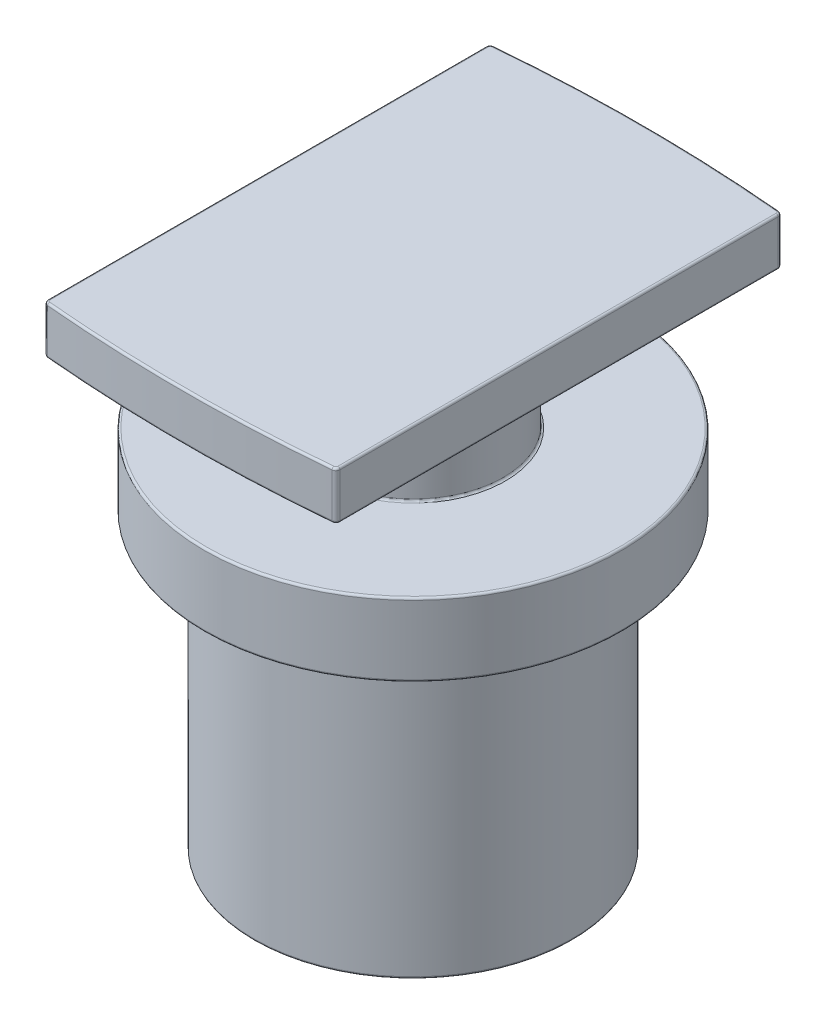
ISO-10303-21;
HEADER;
FILE_DESCRIPTION(('STEP AP214'),'2;1');
FILE_NAME('part.step','',(''),(''),'','','');
FILE_SCHEMA(('AUTOMOTIVE_DESIGN { 1 0 10303 214 1 1 1 1 }'));
ENDSEC;
DATA;
#1=APPLICATION_CONTEXT('core data for automotive mechanical design processes');
#2=APPLICATION_PROTOCOL_DEFINITION('international standard','automotive_design',2000,#1);
#3=PRODUCT_CONTEXT('',#1,'mechanical');
#4=PRODUCT('Part','Part','',(#3));
#5=PRODUCT_RELATED_PRODUCT_CATEGORY('part','',(#4));
#6=PRODUCT_DEFINITION_FORMATION('','',#4);
#7=PRODUCT_DEFINITION_CONTEXT('part definition',#1,'design');
#8=PRODUCT_DEFINITION('design','',#6,#7);
#9=PRODUCT_DEFINITION_SHAPE('','',#8);
#10=(LENGTH_UNIT() NAMED_UNIT(*) SI_UNIT(.MILLI.,.METRE.));
#11=(NAMED_UNIT(*) PLANE_ANGLE_UNIT() SI_UNIT($,.RADIAN.));
#12=(NAMED_UNIT(*) SI_UNIT($,.STERADIAN.) SOLID_ANGLE_UNIT());
#13=UNCERTAINTY_MEASURE_WITH_UNIT(LENGTH_MEASURE(1.E-05),#10,'distance_accuracy_value','');
#14=(GEOMETRIC_REPRESENTATION_CONTEXT(3) GLOBAL_UNCERTAINTY_ASSIGNED_CONTEXT((#13)) GLOBAL_UNIT_ASSIGNED_CONTEXT((#10,
#11,#12)) REPRESENTATION_CONTEXT('',''));
#15=CARTESIAN_POINT('',(0.,0.,0.));
#16=DIRECTION('',(0.,0.,1.));
#17=DIRECTION('',(1.,0.,0.));
#18=AXIS2_PLACEMENT_3D('',#15,#16,#17);
#19=CARTESIAN_POINT('',(0.,14.,0.));
#20=DIRECTION('',(0.,-1.,0.));
#21=DIRECTION('',(0.,0.,-1.));
#22=AXIS2_PLACEMENT_3D('',#19,#20,#21);
#23=CYLINDRICAL_SURFACE('',#22,7.625);
#24=CARTESIAN_POINT('',(0.,0.0999999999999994,0.));
#25=DIRECTION('',(0.,1.,0.));
#26=DIRECTION('',(0.,0.,1.));
#27=AXIS2_PLACEMENT_3D('',#24,#25,#26);
#28=CIRCLE('',#27,7.625);
#29=CARTESIAN_POINT('',(0.,0.0999999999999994,7.625));
#30=VERTEX_POINT('',#29);
#31=EDGE_CURVE('E361',#30,#30,#28,.T.);
#32=ORIENTED_EDGE('',*,*,#31,.T.);
#33=EDGE_LOOP('',(#32));
#34=FACE_BOUND('',#33,.T.);
#35=CARTESIAN_POINT('',(0.,13.9,0.));
#36=DIRECTION('',(0.,1.,0.));
#37=DIRECTION('',(0.,0.,1.));
#38=AXIS2_PLACEMENT_3D('',#35,#36,#37);
#39=CIRCLE('',#38,7.625);
#40=CARTESIAN_POINT('',(0.,13.9,7.625));
#41=VERTEX_POINT('',#40);
#42=EDGE_CURVE('E358',#41,#41,#39,.F.);
#43=ORIENTED_EDGE('',*,*,#42,.T.);
#44=EDGE_LOOP('',(#43));
#45=FACE_BOUND('',#44,.T.);
#46=ADVANCED_FACE('F34',(#34,#45),#23,.T.);
#47=CARTESIAN_POINT('',(0.,0.,0.));
#48=DIRECTION('',(0.,1.,0.));
#49=DIRECTION('',(0.,0.,1.));
#50=AXIS2_PLACEMENT_3D('',#47,#48,#49);
#51=PLANE('',#50);
#52=CARTESIAN_POINT('',(0.,0.,0.));
#53=DIRECTION('',(0.,-1.,0.));
#54=DIRECTION('',(0.,0.,-1.));
#55=AXIS2_PLACEMENT_3D('',#52,#53,#54);
#56=CIRCLE('',#55,6.12500000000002);
#57=CARTESIAN_POINT('',(5.72499999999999,0.,2.17715410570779));
#58=VERTEX_POINT('',#57);
#59=CARTESIAN_POINT('',(-5.725,0.,2.17715410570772));
#60=VERTEX_POINT('',#59);
#61=EDGE_CURVE('E275',#58,#60,#56,.T.);
#62=ORIENTED_EDGE('',*,*,#61,.F.);
#63=DIRECTION('',(0.,0.,1.));
#64=VECTOR('',#63,1.);
#65=CARTESIAN_POINT('',(5.72500000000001,0.,2.1771541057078));
#66=LINE('',#65,#64);
#67=CARTESIAN_POINT('',(5.72500000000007,0.,-2.17715410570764));
#68=VERTEX_POINT('',#67);
#69=EDGE_CURVE('E268',#68,#58,#66,.T.);
#70=ORIENTED_EDGE('',*,*,#69,.F.);
#71=CARTESIAN_POINT('',(0.,0.,0.));
#72=DIRECTION('',(0.,-1.,0.));
#73=DIRECTION('',(0.,0.,-1.));
#74=AXIS2_PLACEMENT_3D('',#71,#72,#73);
#75=CIRCLE('',#74,6.12500000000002);
#76=CARTESIAN_POINT('',(-5.72500000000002,0.,-2.17715410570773));
#77=VERTEX_POINT('',#76);
#78=EDGE_CURVE('E279',#77,#68,#75,.T.);
#79=ORIENTED_EDGE('',*,*,#78,.F.);
#80=DIRECTION('',(0.,0.,-1.));
#81=VECTOR('',#80,1.);
#82=CARTESIAN_POINT('',(-5.725,0.,2.17715410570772));
#83=LINE('',#82,#81);
#84=EDGE_CURVE('E51',#60,#77,#83,.T.);
#85=ORIENTED_EDGE('',*,*,#84,.F.);
#86=EDGE_LOOP('',(#62,#70,#79,#85));
#87=FACE_BOUND('',#86,.T.);
#88=CARTESIAN_POINT('',(0.,0.,0.));
#89=DIRECTION('',(0.,1.,0.));
#90=DIRECTION('',(0.,0.,1.));
#91=AXIS2_PLACEMENT_3D('',#88,#89,#90);
#92=CIRCLE('',#91,7.525);
#93=CARTESIAN_POINT('',(0.,0.,7.525));
#94=VERTEX_POINT('',#93);
#95=EDGE_CURVE('E364',#94,#94,#92,.F.);
#96=ORIENTED_EDGE('',*,*,#95,.T.);
#97=EDGE_LOOP('',(#96));
#98=FACE_BOUND('',#97,.T.);
#99=ADVANCED_FACE('F649',(#87,#98),#51,.F.);
#100=CARTESIAN_POINT('',(0.,17.5,0.));
#101=DIRECTION('',(0.,-1.,0.));
#102=DIRECTION('',(0.,0.,-1.));
#103=AXIS2_PLACEMENT_3D('',#100,#101,#102);
#104=CYLINDRICAL_SURFACE('',#103,10.);
#105=CARTESIAN_POINT('',(0.,14.1,0.));
#106=DIRECTION('',(0.,1.,0.));
#107=DIRECTION('',(0.,0.,1.));
#108=AXIS2_PLACEMENT_3D('',#105,#106,#107);
#109=CIRCLE('',#108,10.);
#110=CARTESIAN_POINT('',(0.,14.1,10.));
#111=VERTEX_POINT('',#110);
#112=EDGE_CURVE('E376',#111,#111,#109,.T.);
#113=ORIENTED_EDGE('',*,*,#112,.T.);
#114=EDGE_LOOP('',(#113));
#115=FACE_BOUND('',#114,.T.);
#116=CARTESIAN_POINT('',(0.,17.4,0.));
#117=DIRECTION('',(0.,1.,0.));
#118=DIRECTION('',(0.,0.,1.));
#119=AXIS2_PLACEMENT_3D('',#116,#117,#118);
#120=CIRCLE('',#119,10.);
#121=CARTESIAN_POINT('',(0.,17.4,10.));
#122=VERTEX_POINT('',#121);
#123=EDGE_CURVE('E373',#122,#122,#120,.F.);
#124=ORIENTED_EDGE('',*,*,#123,.T.);
#125=EDGE_LOOP('',(#124));
#126=FACE_BOUND('',#125,.T.);
#127=ADVANCED_FACE('F655',(#115,#126),#104,.T.);
#128=CARTESIAN_POINT('',(0.,17.5,0.));
#129=DIRECTION('',(0.,1.,0.));
#130=DIRECTION('',(0.,0.,1.));
#131=AXIS2_PLACEMENT_3D('',#128,#129,#130);
#132=PLANE('',#131);
#133=CARTESIAN_POINT('',(0.,17.5,0.));
#134=DIRECTION('',(0.,1.,0.));
#135=DIRECTION('',(0.,0.,1.));
#136=AXIS2_PLACEMENT_3D('',#133,#134,#135);
#137=CIRCLE('',#136,4.43);
#138=CARTESIAN_POINT('',(0.,17.5,4.43));
#139=VERTEX_POINT('',#138);
#140=EDGE_CURVE('E338',#139,#139,#137,.F.);
#141=ORIENTED_EDGE('',*,*,#140,.T.);
#142=EDGE_LOOP('',(#141));
#143=FACE_BOUND('',#142,.T.);
#144=CARTESIAN_POINT('',(0.,17.5,0.));
#145=DIRECTION('',(0.,1.,0.));
#146=DIRECTION('',(0.,0.,1.));
#147=AXIS2_PLACEMENT_3D('',#144,#145,#146);
#148=CIRCLE('',#147,9.9);
#149=CARTESIAN_POINT('',(0.,17.5,9.9));
#150=VERTEX_POINT('',#149);
#151=EDGE_CURVE('E335',#150,#150,#148,.T.);
#152=ORIENTED_EDGE('',*,*,#151,.T.);
#153=EDGE_LOOP('',(#152));
#154=FACE_BOUND('',#153,.T.);
#155=ADVANCED_FACE('F801',(#143,#154),#132,.T.);
#156=CARTESIAN_POINT('',(0.,14.,0.));
#157=DIRECTION('',(0.,1.,0.));
#158=DIRECTION('',(0.,0.,1.));
#159=AXIS2_PLACEMENT_3D('',#156,#157,#158);
#160=PLANE('',#159);
#161=CARTESIAN_POINT('',(0.,14.,0.));
#162=DIRECTION('',(0.,1.,0.));
#163=DIRECTION('',(0.,0.,1.));
#164=AXIS2_PLACEMENT_3D('',#161,#162,#163);
#165=CIRCLE('',#164,7.725);
#166=CARTESIAN_POINT('',(0.,14.,7.725));
#167=VERTEX_POINT('',#166);
#168=EDGE_CURVE('E370',#167,#167,#165,.T.);
#169=ORIENTED_EDGE('',*,*,#168,.T.);
#170=EDGE_LOOP('',(#169));
#171=FACE_BOUND('',#170,.T.);
#172=CARTESIAN_POINT('',(0.,14.,0.));
#173=DIRECTION('',(0.,1.,0.));
#174=DIRECTION('',(0.,0.,1.));
#175=AXIS2_PLACEMENT_3D('',#172,#173,#174);
#176=CIRCLE('',#175,9.9);
#177=CARTESIAN_POINT('',(0.,14.,9.9));
#178=VERTEX_POINT('',#177);
#179=EDGE_CURVE('E367',#178,#178,#176,.F.);
#180=ORIENTED_EDGE('',*,*,#179,.T.);
#181=EDGE_LOOP('',(#180));
#182=FACE_BOUND('',#181,.T.);
#183=ADVANCED_FACE('F677',(#171,#182),#160,.F.);
#184=CARTESIAN_POINT('',(0.,22.3,0.));
#185=DIRECTION('',(0.,-1.,0.));
#186=DIRECTION('',(0.,0.,-1.));
#187=AXIS2_PLACEMENT_3D('',#184,#185,#186);
#188=CYLINDRICAL_SURFACE('',#187,4.33);
#189=CARTESIAN_POINT('',(0.,17.6,0.));
#190=DIRECTION('',(0.,1.,0.));
#191=DIRECTION('',(0.,0.,1.));
#192=AXIS2_PLACEMENT_3D('',#189,#190,#191);
#193=CIRCLE('',#192,4.33);
#194=CARTESIAN_POINT('',(0.,17.6,4.33));
#195=VERTEX_POINT('',#194);
#196=EDGE_CURVE('E332',#195,#195,#193,.T.);
#197=ORIENTED_EDGE('',*,*,#196,.T.);
#198=EDGE_LOOP('',(#197));
#199=FACE_BOUND('',#198,.T.);
#200=DIRECTION('',(0.,-1.,0.));
#201=VECTOR('',#200,1.);
#202=CARTESIAN_POINT('',(-4.32889666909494,22.3,0.0977426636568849));
#203=LINE('',#202,#201);
#204=CARTESIAN_POINT('',(-4.32889666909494,22.2,0.0977426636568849));
#205=VERTEX_POINT('',#204);
#206=CARTESIAN_POINT('',(-4.32889666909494,20.2,0.0977426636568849));
#207=VERTEX_POINT('',#206);
#208=EDGE_CURVE('E327',#205,#207,#203,.T.);
#209=ORIENTED_EDGE('',*,*,#208,.T.);
#210=CARTESIAN_POINT('',(0.,20.2,0.));
#211=DIRECTION('',(0.,-1.,0.));
#212=DIRECTION('',(1.,0.,0.));
#213=AXIS2_PLACEMENT_3D('',#210,#211,#212);
#214=CIRCLE('',#213,4.33);
#215=CARTESIAN_POINT('',(0.0977426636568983,20.2,-4.32889666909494));
#216=VERTEX_POINT('',#215);
#217=EDGE_CURVE('E330',#207,#216,#214,.T.);
#218=ORIENTED_EDGE('',*,*,#217,.T.);
#219=DIRECTION('',(0.,-1.,0.));
#220=VECTOR('',#219,1.);
#221=CARTESIAN_POINT('',(0.0977426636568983,22.3,-4.32889666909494));
#222=LINE('',#221,#220);
#223=CARTESIAN_POINT('',(0.0977426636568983,22.2,-4.32889666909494));
#224=VERTEX_POINT('',#223);
#225=EDGE_CURVE('E325',#216,#224,#222,.F.);
#226=ORIENTED_EDGE('',*,*,#225,.T.);
#227=CARTESIAN_POINT('',(0.,22.2,0.));
#228=DIRECTION('',(0.,-1.,0.));
#229=DIRECTION('',(0.,0.,-1.));
#230=AXIS2_PLACEMENT_3D('',#227,#228,#229);
#231=CIRCLE('',#230,4.33);
#232=EDGE_CURVE('E323',#224,#205,#231,.T.);
#233=ORIENTED_EDGE('',*,*,#232,.T.);
#234=EDGE_LOOP('',(#209,#218,#226,#233));
#235=FACE_BOUND('',#234,.T.);
#236=ADVANCED_FACE('F673',(#199,#235),#188,.T.);
#237=CARTESIAN_POINT('',(-6.8,24.6,10.4957519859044));
#238=DIRECTION('',(0.,-1.,0.));
#239=DIRECTION('',(0.,0.,-1.));
#240=AXIS2_PLACEMENT_3D('',#237,#238,#239);
#241=CYLINDRICAL_SURFACE('',#240,0.199999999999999);
#242=DIRECTION('',(0.,-1.,0.));
#243=VECTOR('',#242,1.);
#244=CARTESIAN_POINT('',(-7.,24.6,10.4957519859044));
#245=LINE('',#244,#243);
#246=CARTESIAN_POINT('',(-7.,24.5,10.4957519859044));
#247=VERTEX_POINT('',#246);
#248=CARTESIAN_POINT('',(-7.,22.4,10.4957519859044));
#249=VERTEX_POINT('',#248);
#250=EDGE_CURVE('E299',#247,#249,#245,.T.);
#251=ORIENTED_EDGE('',*,*,#250,.T.);
#252=CARTESIAN_POINT('',(-6.8,22.4,10.4957519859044));
#253=DIRECTION('',(0.,-1.,0.));
#254=DIRECTION('',(0.,0.,-1.));
#255=AXIS2_PLACEMENT_3D('',#252,#253,#254);
#256=CIRCLE('',#255,0.199999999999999);
#257=CARTESIAN_POINT('',(-6.81786118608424,22.4,10.6949528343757));
#258=VERTEX_POINT('',#257);
#259=EDGE_CURVE('E452',#249,#258,#256,.F.);
#260=ORIENTED_EDGE('',*,*,#259,.T.);
#261=DIRECTION('',(0.,-1.,0.));
#262=VECTOR('',#261,1.);
#263=CARTESIAN_POINT('',(-6.81786118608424,24.6,10.6949528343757));
#264=LINE('',#263,#262);
#265=CARTESIAN_POINT('',(-6.81786118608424,24.5,10.6949528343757));
#266=VERTEX_POINT('',#265);
#267=EDGE_CURVE('E320',#266,#258,#264,.T.);
#268=ORIENTED_EDGE('',*,*,#267,.F.);
#269=CARTESIAN_POINT('',(-6.8,24.5,10.4957519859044));
#270=DIRECTION('',(0.,-1.,0.));
#271=DIRECTION('',(0.,0.,-1.));
#272=AXIS2_PLACEMENT_3D('',#269,#270,#271);
#273=CIRCLE('',#272,0.199999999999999);
#274=EDGE_CURVE('E450',#266,#247,#273,.T.);
#275=ORIENTED_EDGE('',*,*,#274,.T.);
#276=EDGE_LOOP('',(#251,#260,#268,#275));
#277=FACE_BOUND('',#276,.T.);
#278=ADVANCED_FACE('F676',(#277),#241,.T.);
#279=CARTESIAN_POINT('',(0.,24.6,-65.3427597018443));
#280=DIRECTION('',(0.,-1.,0.));
#281=DIRECTION('',(0.,0.,-1.));
#282=AXIS2_PLACEMENT_3D('',#279,#280,#281);
#283=CYLINDRICAL_SURFACE('',#282,76.3427597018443);
#284=ORIENTED_EDGE('',*,*,#267,.T.);
#285=CARTESIAN_POINT('',(0.,22.4,-65.3427597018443));
#286=DIRECTION('',(0.,-1.,0.));
#287=DIRECTION('',(0.,0.,-1.));
#288=AXIS2_PLACEMENT_3D('',#285,#286,#287);
#289=CIRCLE('',#288,76.3427597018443);
#290=CARTESIAN_POINT('',(6.81786118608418,22.4,10.6949528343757));
#291=VERTEX_POINT('',#290);
#292=EDGE_CURVE('E390',#258,#291,#289,.F.);
#293=ORIENTED_EDGE('',*,*,#292,.T.);
#294=DIRECTION('',(0.,-1.,0.));
#295=VECTOR('',#294,1.);
#296=CARTESIAN_POINT('',(6.81786118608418,24.6,10.6949528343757));
#297=LINE('',#296,#295);
#298=CARTESIAN_POINT('',(6.81786118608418,24.5,10.6949528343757));
#299=VERTEX_POINT('',#298);
#300=EDGE_CURVE('E317',#299,#291,#297,.T.);
#301=ORIENTED_EDGE('',*,*,#300,.F.);
#302=CARTESIAN_POINT('',(0.,24.5,-65.3427597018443));
#303=DIRECTION('',(0.,-1.,0.));
#304=DIRECTION('',(0.,0.,-1.));
#305=AXIS2_PLACEMENT_3D('',#302,#303,#304);
#306=CIRCLE('',#305,76.3427597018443);
#307=EDGE_CURVE('E388',#299,#266,#306,.T.);
#308=ORIENTED_EDGE('',*,*,#307,.T.);
#309=EDGE_LOOP('',(#284,#293,#301,#308));
#310=FACE_BOUND('',#309,.T.);
#311=ADVANCED_FACE('F793',(#310),#283,.T.);
#312=CARTESIAN_POINT('',(6.80000000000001,24.6,10.4957519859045));
#313=DIRECTION('',(0.,-1.,0.));
#314=DIRECTION('',(0.,0.,-1.));
#315=AXIS2_PLACEMENT_3D('',#312,#313,#314);
#316=CYLINDRICAL_SURFACE('',#315,0.2);
#317=ORIENTED_EDGE('',*,*,#300,.T.);
#318=CARTESIAN_POINT('',(6.80000000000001,22.4,10.4957519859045));
#319=DIRECTION('',(0.,-1.,0.));
#320=DIRECTION('',(0.,0.,-1.));
#321=AXIS2_PLACEMENT_3D('',#318,#319,#320);
#322=CIRCLE('',#321,0.2);
#323=CARTESIAN_POINT('',(7.,22.4,10.4957519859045));
#324=VERTEX_POINT('',#323);
#325=EDGE_CURVE('E427',#291,#324,#322,.F.);
#326=ORIENTED_EDGE('',*,*,#325,.T.);
#327=DIRECTION('',(0.,-1.,0.));
#328=VECTOR('',#327,1.);
#329=CARTESIAN_POINT('',(7.,24.6,10.4957519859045));
#330=LINE('',#329,#328);
#331=CARTESIAN_POINT('',(7.,24.5,10.4957519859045));
#332=VERTEX_POINT('',#331);
#333=EDGE_CURVE('E314',#332,#324,#330,.T.);
#334=ORIENTED_EDGE('',*,*,#333,.F.);
#335=CARTESIAN_POINT('',(6.80000000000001,24.5,10.4957519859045));
#336=DIRECTION('',(0.,-1.,0.));
#337=DIRECTION('',(0.,0.,-1.));
#338=AXIS2_PLACEMENT_3D('',#335,#336,#337);
#339=CIRCLE('',#338,0.2);
#340=EDGE_CURVE('E425',#332,#299,#339,.T.);
#341=ORIENTED_EDGE('',*,*,#340,.T.);
#342=EDGE_LOOP('',(#317,#326,#334,#341));
#343=FACE_BOUND('',#342,.T.);
#344=ADVANCED_FACE('F789',(#343),#316,.T.);
#345=CARTESIAN_POINT('',(7.,24.6,10.4957519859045));
#346=DIRECTION('',(-1.,0.,0.));
#347=DIRECTION('',(0.,0.,1.));
#348=AXIS2_PLACEMENT_3D('',#345,#346,#347);
#349=PLANE('',#348);
#350=ORIENTED_EDGE('',*,*,#333,.T.);
#351=DIRECTION('',(0.,0.,-1.));
#352=VECTOR('',#351,1.);
#353=CARTESIAN_POINT('',(7.,22.4,-10.4957519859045));
#354=LINE('',#353,#352);
#355=CARTESIAN_POINT('',(7.,22.4,-10.4957519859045));
#356=VERTEX_POINT('',#355);
#357=EDGE_CURVE('E431',#324,#356,#354,.T.);
#358=ORIENTED_EDGE('',*,*,#357,.T.);
#359=DIRECTION('',(0.,-1.,0.));
#360=VECTOR('',#359,1.);
#361=CARTESIAN_POINT('',(7.,24.6,-10.4957519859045));
#362=LINE('',#361,#360);
#363=CARTESIAN_POINT('',(7.,24.5,-10.4957519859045));
#364=VERTEX_POINT('',#363);
#365=EDGE_CURVE('E311',#364,#356,#362,.T.);
#366=ORIENTED_EDGE('',*,*,#365,.F.);
#367=DIRECTION('',(0.,0.,-1.));
#368=VECTOR('',#367,1.);
#369=CARTESIAN_POINT('',(7.,24.5,10.4957519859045));
#370=LINE('',#369,#368);
#371=EDGE_CURVE('E429',#364,#332,#370,.F.);
#372=ORIENTED_EDGE('',*,*,#371,.T.);
#373=EDGE_LOOP('',(#350,#358,#366,#372));
#374=FACE_BOUND('',#373,.T.);
#375=ADVANCED_FACE('F785',(#374),#349,.F.);
#376=CARTESIAN_POINT('',(6.80000000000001,24.6,-10.4957519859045));
#377=DIRECTION('',(0.,-1.,0.));
#378=DIRECTION('',(0.,0.,-1.));
#379=AXIS2_PLACEMENT_3D('',#376,#377,#378);
#380=CYLINDRICAL_SURFACE('',#379,0.2);
#381=ORIENTED_EDGE('',*,*,#365,.T.);
#382=CARTESIAN_POINT('',(6.80000000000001,22.4,-10.4957519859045));
#383=DIRECTION('',(0.,-1.,0.));
#384=DIRECTION('',(0.,0.,-1.));
#385=AXIS2_PLACEMENT_3D('',#382,#383,#384);
#386=CIRCLE('',#385,0.2);
#387=CARTESIAN_POINT('',(6.81786118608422,22.4,-10.6949528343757));
#388=VERTEX_POINT('',#387);
#389=EDGE_CURVE('E435',#356,#388,#386,.F.);
#390=ORIENTED_EDGE('',*,*,#389,.T.);
#391=DIRECTION('',(0.,-1.,0.));
#392=VECTOR('',#391,1.);
#393=CARTESIAN_POINT('',(6.81786118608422,24.6,-10.6949528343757));
#394=LINE('',#393,#392);
#395=CARTESIAN_POINT('',(6.81786118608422,24.5,-10.6949528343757));
#396=VERTEX_POINT('',#395);
#397=EDGE_CURVE('E308',#396,#388,#394,.T.);
#398=ORIENTED_EDGE('',*,*,#397,.F.);
#399=CARTESIAN_POINT('',(6.80000000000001,24.5,-10.4957519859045));
#400=DIRECTION('',(0.,-1.,0.));
#401=DIRECTION('',(0.,0.,-1.));
#402=AXIS2_PLACEMENT_3D('',#399,#400,#401);
#403=CIRCLE('',#402,0.2);
#404=EDGE_CURVE('E433',#396,#364,#403,.T.);
#405=ORIENTED_EDGE('',*,*,#404,.T.);
#406=EDGE_LOOP('',(#381,#390,#398,#405));
#407=FACE_BOUND('',#406,.T.);
#408=ADVANCED_FACE('F781',(#407),#380,.T.);
#409=CARTESIAN_POINT('',(0.,24.6,65.3427597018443));
#410=DIRECTION('',(0.,-1.,0.));
#411=DIRECTION('',(0.,0.,-1.));
#412=AXIS2_PLACEMENT_3D('',#409,#410,#411);
#413=CYLINDRICAL_SURFACE('',#412,76.3427597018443);
#414=ORIENTED_EDGE('',*,*,#397,.T.);
#415=CARTESIAN_POINT('',(0.,22.4,65.3427597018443));
#416=DIRECTION('',(0.,-1.,0.));
#417=DIRECTION('',(0.,0.,-1.));
#418=AXIS2_PLACEMENT_3D('',#415,#416,#417);
#419=CIRCLE('',#418,76.3427597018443);
#420=CARTESIAN_POINT('',(-6.81786118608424,22.4,-10.6949528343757));
#421=VERTEX_POINT('',#420);
#422=EDGE_CURVE('E439',#388,#421,#419,.F.);
#423=ORIENTED_EDGE('',*,*,#422,.T.);
#424=DIRECTION('',(0.,-1.,0.));
#425=VECTOR('',#424,1.);
#426=CARTESIAN_POINT('',(-6.81786118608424,24.6,-10.6949528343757));
#427=LINE('',#426,#425);
#428=CARTESIAN_POINT('',(-6.81786118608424,24.5,-10.6949528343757));
#429=VERTEX_POINT('',#428);
#430=EDGE_CURVE('E305',#429,#421,#427,.T.);
#431=ORIENTED_EDGE('',*,*,#430,.F.);
#432=CARTESIAN_POINT('',(0.,24.5,65.3427597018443));
#433=DIRECTION('',(0.,-1.,0.));
#434=DIRECTION('',(0.,0.,-1.));
#435=AXIS2_PLACEMENT_3D('',#432,#433,#434);
#436=CIRCLE('',#435,76.3427597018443);
#437=EDGE_CURVE('E437',#429,#396,#436,.T.);
#438=ORIENTED_EDGE('',*,*,#437,.T.);
#439=EDGE_LOOP('',(#414,#423,#431,#438));
#440=FACE_BOUND('',#439,.T.);
#441=ADVANCED_FACE('F777',(#440),#413,.T.);
#442=CARTESIAN_POINT('',(-6.80000000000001,24.6,-10.4957519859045));
#443=DIRECTION('',(0.,-1.,0.));
#444=DIRECTION('',(0.,0.,-1.));
#445=AXIS2_PLACEMENT_3D('',#442,#443,#444);
#446=CYLINDRICAL_SURFACE('',#445,0.199999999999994);
#447=ORIENTED_EDGE('',*,*,#430,.T.);
#448=CARTESIAN_POINT('',(-6.80000000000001,22.4,-10.4957519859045));
#449=DIRECTION('',(0.,-1.,0.));
#450=DIRECTION('',(0.,0.,-1.));
#451=AXIS2_PLACEMENT_3D('',#448,#449,#450);
#452=CIRCLE('',#451,0.199999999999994);
#453=CARTESIAN_POINT('',(-7.,22.4,-10.4957519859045));
#454=VERTEX_POINT('',#453);
#455=EDGE_CURVE('E443',#421,#454,#452,.F.);
#456=ORIENTED_EDGE('',*,*,#455,.T.);
#457=DIRECTION('',(0.,-1.,0.));
#458=VECTOR('',#457,1.);
#459=CARTESIAN_POINT('',(-7.,24.6,-10.4957519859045));
#460=LINE('',#459,#458);
#461=CARTESIAN_POINT('',(-7.,24.5,-10.4957519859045));
#462=VERTEX_POINT('',#461);
#463=EDGE_CURVE('E302',#462,#454,#460,.T.);
#464=ORIENTED_EDGE('',*,*,#463,.F.);
#465=CARTESIAN_POINT('',(-6.80000000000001,24.5,-10.4957519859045));
#466=DIRECTION('',(0.,-1.,0.));
#467=DIRECTION('',(0.,0.,-1.));
#468=AXIS2_PLACEMENT_3D('',#465,#466,#467);
#469=CIRCLE('',#468,0.199999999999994);
#470=EDGE_CURVE('E441',#462,#429,#469,.T.);
#471=ORIENTED_EDGE('',*,*,#470,.T.);
#472=EDGE_LOOP('',(#447,#456,#464,#471));
#473=FACE_BOUND('',#472,.T.);
#474=ADVANCED_FACE('F773',(#473),#446,.T.);
#475=CARTESIAN_POINT('',(-7.,24.6,10.4957519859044));
#476=DIRECTION('',(1.,0.,0.));
#477=DIRECTION('',(0.,0.,-1.));
#478=AXIS2_PLACEMENT_3D('',#475,#476,#477);
#479=PLANE('',#478);
#480=ORIENTED_EDGE('',*,*,#463,.T.);
#481=DIRECTION('',(0.,0.,1.));
#482=VECTOR('',#481,1.);
#483=CARTESIAN_POINT('',(-7.,22.4,10.4957519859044));
#484=LINE('',#483,#482);
#485=EDGE_CURVE('E448',#454,#249,#484,.T.);
#486=ORIENTED_EDGE('',*,*,#485,.T.);
#487=ORIENTED_EDGE('',*,*,#250,.F.);
#488=DIRECTION('',(0.,0.,1.));
#489=VECTOR('',#488,1.);
#490=CARTESIAN_POINT('',(-7.,24.5,10.4957519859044));
#491=LINE('',#490,#489);
#492=EDGE_CURVE('E445',#247,#462,#491,.F.);
#493=ORIENTED_EDGE('',*,*,#492,.T.);
#494=EDGE_LOOP('',(#480,#486,#487,#493));
#495=FACE_BOUND('',#494,.T.);
#496=ADVANCED_FACE('F767',(#495),#479,.F.);
#497=CARTESIAN_POINT('',(-6.8,24.6,10.4957519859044));
#498=DIRECTION('',(0.,-1.,0.));
#499=DIRECTION('',(0.,0.,-1.));
#500=AXIS2_PLACEMENT_3D('',#497,#498,#499);
#501=PLANE('',#500);
#502=CARTESIAN_POINT('',(-6.80000000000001,24.6,-10.4957519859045));
#503=DIRECTION('',(0.,-1.,0.));
#504=DIRECTION('',(0.,0.,-1.));
#505=AXIS2_PLACEMENT_3D('',#502,#503,#504);
#506=CIRCLE('',#505,0.0999999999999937);
#507=CARTESIAN_POINT('',(-6.80893059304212,24.6,-10.5953524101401));
#508=VERTEX_POINT('',#507);
#509=CARTESIAN_POINT('',(-6.9,24.6,-10.4957519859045));
#510=VERTEX_POINT('',#509);
#511=EDGE_CURVE('E59',#508,#510,#506,.F.);
#512=ORIENTED_EDGE('',*,*,#511,.T.);
#513=DIRECTION('',(0.,0.,1.));
#514=VECTOR('',#513,1.);
#515=CARTESIAN_POINT('',(-6.9,24.6,10.4957519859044));
#516=LINE('',#515,#514);
#517=CARTESIAN_POINT('',(-6.9,24.6,10.4957519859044));
#518=VERTEX_POINT('',#517);
#519=EDGE_CURVE('E467',#510,#518,#516,.T.);
#520=ORIENTED_EDGE('',*,*,#519,.T.);
#521=CARTESIAN_POINT('',(-6.8,24.6,10.4957519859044));
#522=DIRECTION('',(0.,-1.,0.));
#523=DIRECTION('',(0.,0.,-1.));
#524=AXIS2_PLACEMENT_3D('',#521,#522,#523);
#525=CIRCLE('',#524,0.099999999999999);
#526=CARTESIAN_POINT('',(-6.80893059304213,24.6,10.5953524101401));
#527=VERTEX_POINT('',#526);
#528=EDGE_CURVE('E454',#518,#527,#525,.F.);
#529=ORIENTED_EDGE('',*,*,#528,.T.);
#530=CARTESIAN_POINT('',(0.,24.6,-65.3427597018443));
#531=DIRECTION('',(0.,-1.,0.));
#532=DIRECTION('',(0.,0.,-1.));
#533=AXIS2_PLACEMENT_3D('',#530,#531,#532);
#534=CIRCLE('',#533,76.2427597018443);
#535=CARTESIAN_POINT('',(6.80893059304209,24.6,10.5953524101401));
#536=VERTEX_POINT('',#535);
#537=EDGE_CURVE('E456',#527,#536,#534,.F.);
#538=ORIENTED_EDGE('',*,*,#537,.T.);
#539=CARTESIAN_POINT('',(6.80000000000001,24.6,10.4957519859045));
#540=DIRECTION('',(0.,-1.,0.));
#541=DIRECTION('',(0.,0.,-1.));
#542=AXIS2_PLACEMENT_3D('',#539,#540,#541);
#543=CIRCLE('',#542,0.0999999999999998);
#544=CARTESIAN_POINT('',(6.9,24.6,10.4957519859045));
#545=VERTEX_POINT('',#544);
#546=EDGE_CURVE('E458',#536,#545,#543,.F.);
#547=ORIENTED_EDGE('',*,*,#546,.T.);
#548=DIRECTION('',(0.,0.,-1.));
#549=VECTOR('',#548,1.);
#550=CARTESIAN_POINT('',(6.9,24.6,10.4957519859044));
#551=LINE('',#550,#549);
#552=CARTESIAN_POINT('',(6.9,24.6,-10.4957519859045));
#553=VERTEX_POINT('',#552);
#554=EDGE_CURVE('E460',#545,#553,#551,.T.);
#555=ORIENTED_EDGE('',*,*,#554,.T.);
#556=CARTESIAN_POINT('',(6.80000000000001,24.6,-10.4957519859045));
#557=DIRECTION('',(0.,-1.,0.));
#558=DIRECTION('',(0.,0.,-1.));
#559=AXIS2_PLACEMENT_3D('',#556,#557,#558);
#560=CIRCLE('',#559,0.0999999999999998);
#561=CARTESIAN_POINT('',(6.80893059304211,24.6,-10.5953524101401));
#562=VERTEX_POINT('',#561);
#563=EDGE_CURVE('E462',#553,#562,#560,.F.);
#564=ORIENTED_EDGE('',*,*,#563,.T.);
#565=CARTESIAN_POINT('',(0.,24.6,65.3427597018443));
#566=DIRECTION('',(0.,-1.,0.));
#567=DIRECTION('',(0.,0.,-1.));
#568=AXIS2_PLACEMENT_3D('',#565,#566,#567);
#569=CIRCLE('',#568,76.2427597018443);
#570=EDGE_CURVE('E464',#562,#508,#569,.F.);
#571=ORIENTED_EDGE('',*,*,#570,.T.);
#572=EDGE_LOOP('',(#512,#520,#529,#538,#547,#555,#564,#571));
#573=FACE_BOUND('',#572,.T.);
#574=ADVANCED_FACE('F764',(#573),#501,.F.);
#575=CARTESIAN_POINT('',(-6.8,22.3,10.4957519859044));
#576=DIRECTION('',(0.,-1.,0.));
#577=DIRECTION('',(0.,0.,-1.));
#578=AXIS2_PLACEMENT_3D('',#575,#576,#577);
#579=PLANE('',#578);
#580=CARTESIAN_POINT('',(6.80000000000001,22.3,10.4957519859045));
#581=DIRECTION('',(0.,-1.,0.));
#582=DIRECTION('',(0.,0.,-1.));
#583=AXIS2_PLACEMENT_3D('',#580,#581,#582);
#584=CIRCLE('',#583,0.0999999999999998);
#585=CARTESIAN_POINT('',(6.9,22.3,10.4957519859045));
#586=VERTEX_POINT('',#585);
#587=CARTESIAN_POINT('',(6.80893059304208,22.3,10.5953524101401));
#588=VERTEX_POINT('',#587);
#589=EDGE_CURVE('E420',#586,#588,#584,.T.);
#590=ORIENTED_EDGE('',*,*,#589,.T.);
#591=CARTESIAN_POINT('',(0.,22.3,-65.3427597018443));
#592=DIRECTION('',(0.,-1.,0.));
#593=DIRECTION('',(0.,0.,-1.));
#594=AXIS2_PLACEMENT_3D('',#591,#592,#593);
#595=CIRCLE('',#594,76.2427597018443);
#596=CARTESIAN_POINT('',(-6.80893059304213,22.3,10.5953524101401));
#597=VERTEX_POINT('',#596);
#598=EDGE_CURVE('E422',#588,#597,#595,.T.);
#599=ORIENTED_EDGE('',*,*,#598,.T.);
#600=CARTESIAN_POINT('',(-6.8,22.3,10.4957519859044));
#601=DIRECTION('',(0.,-1.,0.));
#602=DIRECTION('',(0.,0.,-1.));
#603=AXIS2_PLACEMENT_3D('',#600,#601,#602);
#604=CIRCLE('',#603,0.099999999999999);
#605=CARTESIAN_POINT('',(-6.9,22.3,10.4957519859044));
#606=VERTEX_POINT('',#605);
#607=EDGE_CURVE('E408',#597,#606,#604,.T.);
#608=ORIENTED_EDGE('',*,*,#607,.T.);
#609=DIRECTION('',(0.,0.,1.));
#610=VECTOR('',#609,1.);
#611=CARTESIAN_POINT('',(-6.9,22.3,-10.4957519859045));
#612=LINE('',#611,#610);
#613=CARTESIAN_POINT('',(-6.9,22.3,-10.4957519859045));
#614=VERTEX_POINT('',#613);
#615=EDGE_CURVE('E410',#606,#614,#612,.F.);
#616=ORIENTED_EDGE('',*,*,#615,.T.);
#617=CARTESIAN_POINT('',(-6.80000000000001,22.3,-10.4957519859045));
#618=DIRECTION('',(0.,-1.,0.));
#619=DIRECTION('',(0.,0.,-1.));
#620=AXIS2_PLACEMENT_3D('',#617,#618,#619);
#621=CIRCLE('',#620,0.0999999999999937);
#622=CARTESIAN_POINT('',(-6.80893059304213,22.3,-10.5953524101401));
#623=VERTEX_POINT('',#622);
#624=EDGE_CURVE('E412',#614,#623,#621,.T.);
#625=ORIENTED_EDGE('',*,*,#624,.T.);
#626=CARTESIAN_POINT('',(0.,22.3,65.3427597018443));
#627=DIRECTION('',(0.,-1.,0.));
#628=DIRECTION('',(0.,0.,-1.));
#629=AXIS2_PLACEMENT_3D('',#626,#627,#628);
#630=CIRCLE('',#629,76.2427597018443);
#631=CARTESIAN_POINT('',(6.80893059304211,22.3,-10.5953524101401));
#632=VERTEX_POINT('',#631);
#633=EDGE_CURVE('E414',#623,#632,#630,.T.);
#634=ORIENTED_EDGE('',*,*,#633,.T.);
#635=CARTESIAN_POINT('',(6.80000000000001,22.3,-10.4957519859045));
#636=DIRECTION('',(0.,-1.,0.));
#637=DIRECTION('',(0.,0.,-1.));
#638=AXIS2_PLACEMENT_3D('',#635,#636,#637);
#639=CIRCLE('',#638,0.0999999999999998);
#640=CARTESIAN_POINT('',(6.9,22.3,-10.4957519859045));
#641=VERTEX_POINT('',#640);
#642=EDGE_CURVE('E416',#632,#641,#639,.T.);
#643=ORIENTED_EDGE('',*,*,#642,.T.);
#644=DIRECTION('',(0.,0.,-1.));
#645=VECTOR('',#644,1.);
#646=CARTESIAN_POINT('',(6.9,22.3,10.4957519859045));
#647=LINE('',#646,#645);
#648=EDGE_CURVE('E418',#641,#586,#647,.F.);
#649=ORIENTED_EDGE('',*,*,#648,.T.);
#650=EDGE_LOOP('',(#590,#599,#608,#616,#625,#634,#643,#649));
#651=FACE_BOUND('',#650,.T.);
#652=CARTESIAN_POINT('',(-5.2290438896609,22.3,-0.1));
#653=DIRECTION('',(0.,-1.,0.));
#654=DIRECTION('',(0.,0.,-1.));
#655=AXIS2_PLACEMENT_3D('',#652,#653,#654);
#656=CIRCLE('',#655,0.2);
#657=CARTESIAN_POINT('',(-5.2290438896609,22.3,0.1));
#658=VERTEX_POINT('',#657);
#659=CARTESIAN_POINT('',(-5.42900732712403,22.3,-0.103824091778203));
#660=VERTEX_POINT('',#659);
#661=EDGE_CURVE('E403',#658,#660,#656,.T.);
#662=ORIENTED_EDGE('',*,*,#661,.F.);
#663=DIRECTION('',(-1.,0.,0.));
#664=VECTOR('',#663,1.);
#665=CARTESIAN_POINT('',(-6.8,22.3,0.0999999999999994));
#666=LINE('',#665,#664);
#667=CARTESIAN_POINT('',(-4.42887118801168,22.3,0.1));
#668=VERTEX_POINT('',#667);
#669=EDGE_CURVE('E406',#658,#668,#666,.F.);
#670=ORIENTED_EDGE('',*,*,#669,.T.);
#671=CARTESIAN_POINT('',(0.,22.3,0.));
#672=DIRECTION('',(0.,-1.,0.));
#673=DIRECTION('',(0.,0.,-1.));
#674=AXIS2_PLACEMENT_3D('',#671,#672,#673);
#675=CIRCLE('',#674,4.43);
#676=CARTESIAN_POINT('',(0.100000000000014,22.3,-4.42887118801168));
#677=VERTEX_POINT('',#676);
#678=EDGE_CURVE('E400',#668,#677,#675,.F.);
#679=ORIENTED_EDGE('',*,*,#678,.T.);
#680=DIRECTION('',(0.,0.,-1.));
#681=VECTOR('',#680,1.);
#682=CARTESIAN_POINT('',(0.100000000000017,22.3,-5.33));
#683=LINE('',#682,#681);
#684=CARTESIAN_POINT('',(0.100000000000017,22.3,-5.2290438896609));
#685=VERTEX_POINT('',#684);
#686=EDGE_CURVE('E396',#677,#685,#683,.T.);
#687=ORIENTED_EDGE('',*,*,#686,.T.);
#688=CARTESIAN_POINT('',(-0.0999999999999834,22.3,-5.2290438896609));
#689=DIRECTION('',(0.,-1.,0.));
#690=DIRECTION('',(0.,0.,-1.));
#691=AXIS2_PLACEMENT_3D('',#688,#689,#690);
#692=CIRCLE('',#691,0.2);
#693=CARTESIAN_POINT('',(-0.103824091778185,22.3,-5.42900732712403));
#694=VERTEX_POINT('',#693);
#695=EDGE_CURVE('E393',#694,#685,#692,.T.);
#696=ORIENTED_EDGE('',*,*,#695,.F.);
#697=CARTESIAN_POINT('',(0.,22.3,0.));
#698=DIRECTION('',(0.,-1.,0.));
#699=DIRECTION('',(0.,0.,-1.));
#700=AXIS2_PLACEMENT_3D('',#697,#698,#699);
#701=CIRCLE('',#700,5.43);
#702=EDGE_CURVE('E398',#694,#660,#701,.F.);
#703=ORIENTED_EDGE('',*,*,#702,.T.);
#704=EDGE_LOOP('',(#662,#670,#679,#687,#696,#703));
#705=FACE_BOUND('',#704,.T.);
#706=ADVANCED_FACE('F715',(#651,#705),#579,.T.);
#707=CARTESIAN_POINT('',(0.,20.3,-4.33));
#708=DIRECTION('',(0.,-1.,0.));
#709=DIRECTION('',(1.,0.,0.));
#710=AXIS2_PLACEMENT_3D('',#707,#708,#709);
#711=PLANE('',#710);
#712=DIRECTION('',(0.,0.,1.));
#713=VECTOR('',#712,1.);
#714=CARTESIAN_POINT('',(0.,20.3,-4.33));
#715=LINE('',#714,#713);
#716=CARTESIAN_POINT('',(0.,20.3,-5.2290438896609));
#717=VERTEX_POINT('',#716);
#718=CARTESIAN_POINT('',(0.,20.3,-4.43));
#719=VERTEX_POINT('',#718);
#720=EDGE_CURVE('E295',#717,#719,#715,.T.);
#721=ORIENTED_EDGE('',*,*,#720,.T.);
#722=CARTESIAN_POINT('',(0.,20.3,0.));
#723=DIRECTION('',(0.,-1.,0.));
#724=DIRECTION('',(1.,0.,0.));
#725=AXIS2_PLACEMENT_3D('',#722,#723,#724);
#726=CIRCLE('',#725,4.43);
#727=CARTESIAN_POINT('',(-4.43,20.3,0.));
#728=VERTEX_POINT('',#727);
#729=EDGE_CURVE('E356',#719,#728,#726,.F.);
#730=ORIENTED_EDGE('',*,*,#729,.T.);
#731=DIRECTION('',(1.,0.,0.));
#732=VECTOR('',#731,1.);
#733=CARTESIAN_POINT('',(-4.33,20.3,0.));
#734=LINE('',#733,#732);
#735=CARTESIAN_POINT('',(-5.2290438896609,20.3,0.));
#736=VERTEX_POINT('',#735);
#737=EDGE_CURVE('E290',#736,#728,#734,.T.);
#738=ORIENTED_EDGE('',*,*,#737,.F.);
#739=CARTESIAN_POINT('',(-5.23,20.3,0.));
#740=VERTEX_POINT('',#739);
#741=EDGE_CURVE('E293',#740,#736,#734,.T.);
#742=ORIENTED_EDGE('',*,*,#741,.F.);
#743=CARTESIAN_POINT('',(0.,20.3,0.));
#744=DIRECTION('',(0.,-1.,0.));
#745=DIRECTION('',(1.,0.,0.));
#746=AXIS2_PLACEMENT_3D('',#743,#744,#745);
#747=CIRCLE('',#746,5.23);
#748=CARTESIAN_POINT('',(0.,20.3,-5.23));
#749=VERTEX_POINT('',#748);
#750=EDGE_CURVE('E354',#740,#749,#747,.T.);
#751=ORIENTED_EDGE('',*,*,#750,.T.);
#752=EDGE_CURVE('E298',#749,#717,#715,.T.);
#753=ORIENTED_EDGE('',*,*,#752,.T.);
#754=EDGE_LOOP('',(#721,#730,#738,#742,#751,#753));
#755=FACE_BOUND('',#754,.T.);
#756=ADVANCED_FACE('F750',(#755),#711,.T.);
#757=CARTESIAN_POINT('',(0.,22.3,0.));
#758=DIRECTION('',(0.,1.,0.));
#759=DIRECTION('',(-1.,0.,0.));
#760=AXIS2_PLACEMENT_3D('',#757,#758,#759);
#761=CYLINDRICAL_SURFACE('',#760,5.33);
#762=CARTESIAN_POINT('',(0.,20.4,0.));
#763=DIRECTION('',(0.,-1.,0.));
#764=DIRECTION('',(1.,0.,0.));
#765=AXIS2_PLACEMENT_3D('',#762,#763,#764);
#766=CIRCLE('',#765,5.33);
#767=CARTESIAN_POINT('',(-0.101912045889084,20.4,-5.32902560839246));
#768=VERTEX_POINT('',#767);
#769=CARTESIAN_POINT('',(-5.32902560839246,20.4,-0.101912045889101));
#770=VERTEX_POINT('',#769);
#771=EDGE_CURVE('E383',#768,#770,#766,.F.);
#772=ORIENTED_EDGE('',*,*,#771,.T.);
#773=DIRECTION('',(0.,1.,0.));
#774=VECTOR('',#773,1.);
#775=CARTESIAN_POINT('',(-5.32902560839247,22.3,-0.101912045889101));
#776=LINE('',#775,#774);
#777=CARTESIAN_POINT('',(-5.32902560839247,22.2,-0.101912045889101));
#778=VERTEX_POINT('',#777);
#779=EDGE_CURVE('E385',#770,#778,#776,.T.);
#780=ORIENTED_EDGE('',*,*,#779,.T.);
#781=CARTESIAN_POINT('',(0.,22.2,0.));
#782=DIRECTION('',(0.,-1.,0.));
#783=DIRECTION('',(0.,0.,-1.));
#784=AXIS2_PLACEMENT_3D('',#781,#782,#783);
#785=CIRCLE('',#784,5.33);
#786=CARTESIAN_POINT('',(-0.101912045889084,22.2,-5.32902560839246));
#787=VERTEX_POINT('',#786);
#788=EDGE_CURVE('E379',#778,#787,#785,.T.);
#789=ORIENTED_EDGE('',*,*,#788,.T.);
#790=DIRECTION('',(0.,1.,0.));
#791=VECTOR('',#790,1.);
#792=CARTESIAN_POINT('',(-0.101912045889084,22.3,-5.32902560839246));
#793=LINE('',#792,#791);
#794=EDGE_CURVE('E381',#787,#768,#793,.F.);
#795=ORIENTED_EDGE('',*,*,#794,.T.);
#796=EDGE_LOOP('',(#772,#780,#789,#795));
#797=FACE_BOUND('',#796,.T.);
#798=ADVANCED_FACE('F748',(#797),#761,.T.);
#799=CARTESIAN_POINT('',(0.,0.,0.));
#800=DIRECTION('',(1.,0.,0.));
#801=DIRECTION('',(0.,0.,-1.));
#802=AXIS2_PLACEMENT_3D('',#799,#800,#801);
#803=PLANE('',#802);
#804=DIRECTION('',(0.,0.,-1.));
#805=VECTOR('',#804,1.);
#806=CARTESIAN_POINT('',(0.,22.2,-4.33));
#807=LINE('',#806,#805);
#808=CARTESIAN_POINT('',(0.,22.2,-5.2290438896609));
#809=VERTEX_POINT('',#808);
#810=CARTESIAN_POINT('',(0.,22.2,-4.42887118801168));
#811=VERTEX_POINT('',#810);
#812=EDGE_CURVE('E348',#809,#811,#807,.F.);
#813=ORIENTED_EDGE('',*,*,#812,.T.);
#814=DIRECTION('',(0.,-1.,0.));
#815=VECTOR('',#814,1.);
#816=CARTESIAN_POINT('',(0.,0.,-4.42887118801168));
#817=LINE('',#816,#815);
#818=CARTESIAN_POINT('',(0.,20.3,-4.42887118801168));
#819=VERTEX_POINT('',#818);
#820=EDGE_CURVE('E352',#811,#819,#817,.T.);
#821=ORIENTED_EDGE('',*,*,#820,.T.);
#822=CARTESIAN_POINT('',(0.,20.2,-4.43));
#823=DIRECTION('',(1.,0.,0.));
#824=DIRECTION('',(0.,0.,-1.));
#825=AXIS2_PLACEMENT_3D('',#822,#823,#824);
#826=CIRCLE('',#825,0.1);
#827=EDGE_CURVE('E11',#819,#719,#826,.F.);
#828=ORIENTED_EDGE('',*,*,#827,.T.);
#829=ORIENTED_EDGE('',*,*,#720,.F.);
#830=DIRECTION('',(0.,1.,0.));
#831=VECTOR('',#830,1.);
#832=CARTESIAN_POINT('',(0.,0.,-5.2290438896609));
#833=LINE('',#832,#831);
#834=EDGE_CURVE('E350',#717,#809,#833,.T.);
#835=ORIENTED_EDGE('',*,*,#834,.T.);
#836=EDGE_LOOP('',(#813,#821,#828,#829,#835));
#837=FACE_BOUND('',#836,.T.);
#838=ADVANCED_FACE('F666',(#837),#803,.T.);
#839=CARTESIAN_POINT('',(0.,0.,0.));
#840=DIRECTION('',(0.,0.,-1.));
#841=DIRECTION('',(-1.,0.,0.));
#842=AXIS2_PLACEMENT_3D('',#839,#840,#841);
#843=PLANE('',#842);
#844=ORIENTED_EDGE('',*,*,#737,.T.);
#845=CARTESIAN_POINT('',(-4.43,20.2,0.));
#846=DIRECTION('',(0.,0.,-1.));
#847=DIRECTION('',(-1.,0.,0.));
#848=AXIS2_PLACEMENT_3D('',#845,#846,#847);
#849=CIRCLE('',#848,0.1);
#850=CARTESIAN_POINT('',(-4.42887118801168,20.3,0.));
#851=VERTEX_POINT('',#850);
#852=EDGE_CURVE('E43',#728,#851,#849,.T.);
#853=ORIENTED_EDGE('',*,*,#852,.T.);
#854=DIRECTION('',(0.,1.,0.));
#855=VECTOR('',#854,1.);
#856=CARTESIAN_POINT('',(-4.42887118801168,22.3,0.));
#857=LINE('',#856,#855);
#858=CARTESIAN_POINT('',(-4.42887118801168,22.2,0.));
#859=VERTEX_POINT('',#858);
#860=EDGE_CURVE('E345',#851,#859,#857,.T.);
#861=ORIENTED_EDGE('',*,*,#860,.T.);
#862=DIRECTION('',(-1.,0.,0.));
#863=VECTOR('',#862,1.);
#864=CARTESIAN_POINT('',(0.,22.2,0.));
#865=LINE('',#864,#863);
#866=CARTESIAN_POINT('',(-5.2290438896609,22.2,0.));
#867=VERTEX_POINT('',#866);
#868=EDGE_CURVE('E341',#859,#867,#865,.T.);
#869=ORIENTED_EDGE('',*,*,#868,.T.);
#870=DIRECTION('',(0.,-1.,0.));
#871=VECTOR('',#870,1.);
#872=CARTESIAN_POINT('',(-5.2290438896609,20.3,0.));
#873=LINE('',#872,#871);
#874=EDGE_CURVE('E343',#867,#736,#873,.T.);
#875=ORIENTED_EDGE('',*,*,#874,.T.);
#876=EDGE_LOOP('',(#844,#853,#861,#869,#875));
#877=FACE_BOUND('',#876,.T.);
#878=ADVANCED_FACE('F661',(#877),#843,.F.);
#879=CARTESIAN_POINT('',(0.,17.6,0.));
#880=DIRECTION('',(0.,1.,0.));
#881=DIRECTION('',(0.,0.,1.));
#882=AXIS2_PLACEMENT_3D('',#879,#880,#881);
#883=TOROIDAL_SURFACE('',#882,4.43,0.1);
#884=ORIENTED_EDGE('',*,*,#140,.F.);
#885=EDGE_LOOP('',(#884));
#886=FACE_BOUND('',#885,.T.);
#887=ORIENTED_EDGE('',*,*,#196,.F.);
#888=EDGE_LOOP('',(#887));
#889=FACE_BOUND('',#888,.T.);
#890=ADVANCED_FACE('F567',(#886,#889),#883,.F.);
#891=CARTESIAN_POINT('',(-0.0999999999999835,22.3,-5.2290438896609));
#892=DIRECTION('',(0.,1.,0.));
#893=DIRECTION('',(-1.,0.,0.));
#894=AXIS2_PLACEMENT_3D('',#891,#892,#893);
#895=CYLINDRICAL_SURFACE('',#894,0.1);
#896=ORIENTED_EDGE('',*,*,#834,.F.);
#897=ORIENTED_EDGE('',*,*,#752,.F.);
#898=CARTESIAN_POINT('',(-4.57083933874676E-06,20.3,-5.23));
#899=CARTESIAN_POINT('',(-4.00352385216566E-05,20.2999925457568,-5.23449905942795));
#900=CARTESIAN_POINT('',(-0.000393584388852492,20.3003030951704,-5.23898337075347));
#901=CARTESIAN_POINT('',(-0.00166906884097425,20.3014922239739,-5.24775428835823));
#902=CARTESIAN_POINT('',(-0.00258602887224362,20.3023658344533,-5.25204227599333));
#903=CARTESIAN_POINT('',(-0.00492007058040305,20.3046120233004,-5.26032346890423));
#904=CARTESIAN_POINT('',(-0.0063357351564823,20.305983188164,-5.26431747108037));
#905=CARTESIAN_POINT('',(-0.00958330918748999,20.3091402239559,-5.27196367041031));
#906=CARTESIAN_POINT('',(-0.0114161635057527,20.3109270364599,-5.27561506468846));
#907=CARTESIAN_POINT('',(-0.0162310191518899,20.3156293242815,-5.28394767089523));
#908=CARTESIAN_POINT('',(-0.0193769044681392,20.3187079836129,-5.28844199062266));
#909=CARTESIAN_POINT('',(-0.0261376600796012,20.3253324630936,-5.29666645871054));
#910=CARTESIAN_POINT('',(-0.0297534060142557,20.3288791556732,-5.30039514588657));
#911=CARTESIAN_POINT('',(-0.038740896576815,20.3377021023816,-5.30839071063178));
#912=CARTESIAN_POINT('',(-0.0442599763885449,20.3431255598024,-5.31232872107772));
#913=CARTESIAN_POINT('',(-0.0556660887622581,20.3543448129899,-5.31892143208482));
#914=CARTESIAN_POINT('',(-0.0615535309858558,20.3601410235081,-5.32157467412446));
#915=CARTESIAN_POINT('',(-0.0729337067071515,20.3713572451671,-5.32547996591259));
#916=CARTESIAN_POINT('',(-0.078407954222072,20.376757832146,-5.32684456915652));
#917=CARTESIAN_POINT('',(-0.0894175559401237,20.3876326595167,-5.3286382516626));
#918=CARTESIAN_POINT('',(-0.094952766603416,20.3931067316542,-5.3290691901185));
#919=CARTESIAN_POINT('',(-0.100955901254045,20.3990527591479,-5.32904046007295));
#920=CARTESIAN_POINT('',(-0.101434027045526,20.3995264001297,-5.32903474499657));
#921=CARTESIAN_POINT('',(-0.101912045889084,20.4,-5.32902560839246));
#922=B_SPLINE_CURVE_WITH_KNOTS('',3,(#898,#899,#900,#901,#902,#903,#904,#905,#906,#907,#908,
#909,#910,#911,#912,#913,#914,#915,#916,#917,#918,#919,#920,#921),.UNSPECIFIED.,.F.,.F.,(4,2,2,
2,2,2,2,2,2,2,2,4),(0.,0.0134576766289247,0.0267981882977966,0.04010109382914,
0.0534344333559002,0.0722025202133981,0.0910060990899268,0.116913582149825,0.142850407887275,
0.166224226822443,0.189551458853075,0.191570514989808),.UNSPECIFIED.);
#923=EDGE_CURVE('E294',#768,#749,#922,.F.);
#924=ORIENTED_EDGE('',*,*,#923,.F.);
#925=ORIENTED_EDGE('',*,*,#794,.F.);
#926=CARTESIAN_POINT('',(-0.0999999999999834,22.2,-5.2290438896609));
#927=DIRECTION('',(0.,-1.,0.));
#928=DIRECTION('',(0.,0.,-1.));
#929=AXIS2_PLACEMENT_3D('',#926,#927,#928);
#930=CIRCLE('',#929,0.1);
#931=EDGE_CURVE('E561',#809,#787,#930,.F.);
#932=ORIENTED_EDGE('',*,*,#931,.F.);
#933=EDGE_LOOP('',(#896,#897,#924,#925,#932));
#934=FACE_BOUND('',#933,.T.);
#935=ADVANCED_FACE('F540',(#934),#895,.T.);
#936=CARTESIAN_POINT('',(0.,20.4,0.));
#937=DIRECTION('',(0.,-1.,0.));
#938=DIRECTION('',(1.,0.,0.));
#939=AXIS2_PLACEMENT_3D('',#936,#937,#938);
#940=TOROIDAL_SURFACE('',#939,5.23,0.1);
#941=ORIENTED_EDGE('',*,*,#923,.T.);
#942=ORIENTED_EDGE('',*,*,#750,.F.);
#943=CARTESIAN_POINT('',(-5.23,20.3,-4.57083935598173E-06));
#944=CARTESIAN_POINT('',(-5.23449905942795,20.2999925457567,-4.00352385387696E-05));
#945=CARTESIAN_POINT('',(-5.23898337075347,20.3003030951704,-0.0003935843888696));
#946=CARTESIAN_POINT('',(-5.24775428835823,20.3014922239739,-0.00166906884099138));
#947=CARTESIAN_POINT('',(-5.25204227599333,20.3023658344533,-0.00258602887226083));
#948=CARTESIAN_POINT('',(-5.26032346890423,20.3046120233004,-0.0049200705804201));
#949=CARTESIAN_POINT('',(-5.26431747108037,20.305983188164,-0.00633573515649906));
#950=CARTESIAN_POINT('',(-5.27196367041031,20.3091402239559,-0.00958330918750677));
#951=CARTESIAN_POINT('',(-5.27561506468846,20.3109270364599,-0.0114161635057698));
#952=CARTESIAN_POINT('',(-5.28394767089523,20.3156293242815,-0.0162310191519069));
#953=CARTESIAN_POINT('',(-5.28844199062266,20.3187079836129,-0.0193769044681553));
#954=CARTESIAN_POINT('',(-5.29666645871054,20.3253324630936,-0.0261376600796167));
#955=CARTESIAN_POINT('',(-5.30039514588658,20.3288791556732,-0.0297534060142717));
#956=CARTESIAN_POINT('',(-5.30839071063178,20.3377021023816,-0.0387408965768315));
#957=CARTESIAN_POINT('',(-5.31232872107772,20.3431255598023,-0.0442599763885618));
#958=CARTESIAN_POINT('',(-5.31892143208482,20.3543448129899,-0.0556660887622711));
#959=CARTESIAN_POINT('',(-5.32157467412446,20.3601410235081,-0.0615535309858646));
#960=CARTESIAN_POINT('',(-5.32547996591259,20.3713572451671,-0.0729337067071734));
#961=CARTESIAN_POINT('',(-5.32684456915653,20.376757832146,-0.0784079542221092));
#962=CARTESIAN_POINT('',(-5.3286382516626,20.3876326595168,-0.0894175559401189));
#963=CARTESIAN_POINT('',(-5.3290691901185,20.3931067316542,-0.0949527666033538));
#964=CARTESIAN_POINT('',(-5.32904046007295,20.3990527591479,-0.10095590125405));
#965=CARTESIAN_POINT('',(-5.32903474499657,20.3995264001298,-0.101434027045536));
#966=CARTESIAN_POINT('',(-5.32902560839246,20.4,-0.101912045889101));
#967=B_SPLINE_CURVE_WITH_KNOTS('',3,(#943,#944,#945,#946,#947,#948,#949,#950,#951,#952,#953,
#954,#955,#956,#957,#958,#959,#960,#961,#962,#963,#964,#965,#966),.UNSPECIFIED.,.F.,.F.,(4,2,2,
2,2,2,2,2,2,2,2,4),(0.,0.0134576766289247,0.0267981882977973,0.0401010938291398,
0.0534344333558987,0.0722025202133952,0.0910060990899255,0.116913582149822,0.142850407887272,
0.166224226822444,0.189551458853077,0.191570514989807),.UNSPECIFIED.);
#968=EDGE_CURVE('E546',#770,#740,#967,.F.);
#969=ORIENTED_EDGE('',*,*,#968,.F.);
#970=ORIENTED_EDGE('',*,*,#771,.F.);
#971=EDGE_LOOP('',(#941,#942,#969,#970));
#972=FACE_BOUND('',#971,.T.);
#973=ADVANCED_FACE('F535',(#972),#940,.T.);
#974=CARTESIAN_POINT('',(-0.0999999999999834,22.2,-5.2290438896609));
#975=DIRECTION('',(0.,-1.,0.));
#976=DIRECTION('',(0.,0.,-1.));
#977=AXIS2_PLACEMENT_3D('',#974,#975,#976);
#978=TOROIDAL_SURFACE('',#977,0.2,0.1);
#979=CARTESIAN_POINT('',(0.100000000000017,22.2,-5.2290438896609));
#980=DIRECTION('',(0.,0.,1.));
#981=DIRECTION('',(1.,0.,0.));
#982=AXIS2_PLACEMENT_3D('',#979,#980,#981);
#983=CIRCLE('',#982,0.1);
#984=EDGE_CURVE('E726',#809,#685,#983,.F.);
#985=ORIENTED_EDGE('',*,*,#984,.F.);
#986=ORIENTED_EDGE('',*,*,#931,.T.);
#987=CARTESIAN_POINT('',(-0.103824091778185,22.2,-5.42900732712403));
#988=DIRECTION('',(-0.99981718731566,0.,0.0191204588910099));
#989=DIRECTION('',(0.0191204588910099,0.,0.99981718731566));
#990=AXIS2_PLACEMENT_3D('',#987,#988,#989);
#991=CIRCLE('',#990,0.1);
#992=EDGE_CURVE('E728',#694,#787,#991,.F.);
#993=ORIENTED_EDGE('',*,*,#992,.F.);
#994=ORIENTED_EDGE('',*,*,#695,.T.);
#995=EDGE_LOOP('',(#985,#986,#993,#994));
#996=FACE_BOUND('',#995,.T.);
#997=ADVANCED_FACE('F539',(#996),#978,.F.);
#998=CARTESIAN_POINT('',(-5.2290438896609,22.3,-0.1));
#999=DIRECTION('',(0.,1.,0.));
#1000=DIRECTION('',(-1.,0.,0.));
#1001=AXIS2_PLACEMENT_3D('',#998,#999,#1000);
#1002=CYLINDRICAL_SURFACE('',#1001,0.1);
#1003=ORIENTED_EDGE('',*,*,#741,.T.);
#1004=ORIENTED_EDGE('',*,*,#874,.F.);
#1005=CARTESIAN_POINT('',(-5.2290438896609,22.2,-0.1));
#1006=DIRECTION('',(0.,-1.,0.));
#1007=DIRECTION('',(0.,0.,-1.));
#1008=AXIS2_PLACEMENT_3D('',#1005,#1006,#1007);
#1009=CIRCLE('',#1008,0.1);
#1010=EDGE_CURVE('E720',#778,#867,#1009,.F.);
#1011=ORIENTED_EDGE('',*,*,#1010,.F.);
#1012=ORIENTED_EDGE('',*,*,#779,.F.);
#1013=ORIENTED_EDGE('',*,*,#968,.T.);
#1014=EDGE_LOOP('',(#1003,#1004,#1011,#1012,#1013));
#1015=FACE_BOUND('',#1014,.T.);
#1016=ADVANCED_FACE('F533',(#1015),#1002,.T.);
#1017=CARTESIAN_POINT('',(0.,22.2,0.));
#1018=DIRECTION('',(0.,-1.,0.));
#1019=DIRECTION('',(0.,0.,-1.));
#1020=AXIS2_PLACEMENT_3D('',#1017,#1018,#1019);
#1021=TOROIDAL_SURFACE('',#1020,5.43,0.1);
#1022=ORIENTED_EDGE('',*,*,#992,.T.);
#1023=ORIENTED_EDGE('',*,*,#788,.F.);
#1024=CARTESIAN_POINT('',(-5.42900732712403,22.2,-0.103824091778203));
#1025=DIRECTION('',(0.0191204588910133,0.,-0.99981718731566));
#1026=DIRECTION('',(-0.99981718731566,0.,-0.0191204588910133));
#1027=AXIS2_PLACEMENT_3D('',#1024,#1025,#1026);
#1028=CIRCLE('',#1027,0.1);
#1029=EDGE_CURVE('E723',#660,#778,#1028,.T.);
#1030=ORIENTED_EDGE('',*,*,#1029,.F.);
#1031=ORIENTED_EDGE('',*,*,#702,.F.);
#1032=EDGE_LOOP('',(#1022,#1023,#1030,#1031));
#1033=FACE_BOUND('',#1032,.T.);
#1034=ADVANCED_FACE('F529',(#1033),#1021,.F.);
#1035=CARTESIAN_POINT('',(0.0999999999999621,22.2,10.4957519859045));
#1036=DIRECTION('',(0.,0.,1.));
#1037=DIRECTION('',(1.,0.,0.));
#1038=AXIS2_PLACEMENT_3D('',#1035,#1036,#1037);
#1039=CYLINDRICAL_SURFACE('',#1038,0.1);
#1040=ORIENTED_EDGE('',*,*,#984,.T.);
#1041=ORIENTED_EDGE('',*,*,#686,.F.);
#1042=CARTESIAN_POINT('',(0.100000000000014,22.2,-4.42887118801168));
#1043=DIRECTION('',(0.,0.,-1.));
#1044=DIRECTION('',(0.,1.,0.));
#1045=AXIS2_PLACEMENT_3D('',#1042,#1043,#1044);
#1046=CIRCLE('',#1045,0.1);
#1047=EDGE_CURVE('E709',#811,#677,#1046,.T.);
#1048=ORIENTED_EDGE('',*,*,#1047,.F.);
#1049=ORIENTED_EDGE('',*,*,#812,.F.);
#1050=EDGE_LOOP('',(#1040,#1041,#1048,#1049));
#1051=FACE_BOUND('',#1050,.T.);
#1052=ADVANCED_FACE('F525',(#1051),#1039,.F.);
#1053=CARTESIAN_POINT('',(-5.2290438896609,22.2,-0.1));
#1054=DIRECTION('',(0.,-1.,0.));
#1055=DIRECTION('',(0.,0.,-1.));
#1056=AXIS2_PLACEMENT_3D('',#1053,#1054,#1055);
#1057=TOROIDAL_SURFACE('',#1056,0.2,0.1);
#1058=ORIENTED_EDGE('',*,*,#1029,.T.);
#1059=ORIENTED_EDGE('',*,*,#1010,.T.);
#1060=CARTESIAN_POINT('',(-5.2290438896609,22.2,0.1));
#1061=DIRECTION('',(1.,0.,0.));
#1062=DIRECTION('',(0.,0.,-1.));
#1063=AXIS2_PLACEMENT_3D('',#1060,#1061,#1062);
#1064=CIRCLE('',#1063,0.1);
#1065=EDGE_CURVE('E696',#658,#867,#1064,.F.);
#1066=ORIENTED_EDGE('',*,*,#1065,.F.);
#1067=ORIENTED_EDGE('',*,*,#661,.T.);
#1068=EDGE_LOOP('',(#1058,#1059,#1066,#1067));
#1069=FACE_BOUND('',#1068,.T.);
#1070=ADVANCED_FACE('F521',(#1069),#1057,.F.);
#1071=CARTESIAN_POINT('',(0.100000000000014,22.2,-4.42887118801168));
#1072=DIRECTION('',(0.,0.,1.));
#1073=DIRECTION('',(1.,0.,0.));
#1074=AXIS2_PLACEMENT_3D('',#1071,#1072,#1073);
#1075=SPHERICAL_SURFACE('',#1074,0.1);
#1076=CARTESIAN_POINT('',(0.100000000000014,22.2,-4.42887118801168));
#1077=DIRECTION('',(0.999745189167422,0.,0.0225733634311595));
#1078=DIRECTION('',(0.0225733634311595,0.,-0.999745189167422));
#1079=AXIS2_PLACEMENT_3D('',#1076,#1077,#1078);
#1080=CIRCLE('',#1079,0.1);
#1081=EDGE_CURVE('E503',#224,#677,#1080,.F.);
#1082=ORIENTED_EDGE('',*,*,#1081,.F.);
#1083=CARTESIAN_POINT('',(0.100000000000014,22.2,-4.42887118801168));
#1084=DIRECTION('',(0.,-1.,0.));
#1085=DIRECTION('',(0.,0.,-1.));
#1086=AXIS2_PLACEMENT_3D('',#1083,#1084,#1085);
#1087=CIRCLE('',#1086,0.1);
#1088=EDGE_CURVE('E706',#811,#224,#1087,.F.);
#1089=ORIENTED_EDGE('',*,*,#1088,.F.);
#1090=ORIENTED_EDGE('',*,*,#1047,.T.);
#1091=EDGE_LOOP('',(#1082,#1089,#1090));
#1092=FACE_BOUND('',#1091,.T.);
#1093=ADVANCED_FACE('F511',(#1092),#1075,.F.);
#1094=CARTESIAN_POINT('',(0.100000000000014,22.3,-4.42887118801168));
#1095=DIRECTION('',(0.,-1.,0.));
#1096=DIRECTION('',(0.,0.,-1.));
#1097=AXIS2_PLACEMENT_3D('',#1094,#1095,#1096);
#1098=CYLINDRICAL_SURFACE('',#1097,0.1);
#1099=ORIENTED_EDGE('',*,*,#1088,.T.);
#1100=ORIENTED_EDGE('',*,*,#225,.F.);
#1101=CARTESIAN_POINT('',(0.,20.2999936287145,-4.42887118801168));
#1102=CARTESIAN_POINT('',(-7.53597604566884E-06,20.2999503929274,-4.4243633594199));
#1103=CARTESIAN_POINT('',(0.000304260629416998,20.299587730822,-4.41987107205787));
#1104=CARTESIAN_POINT('',(0.00149738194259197,20.2982924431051,-4.41108660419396));
#1105=CARTESIAN_POINT('',(0.00237364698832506,20.2973648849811,-4.40679300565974));
#1106=CARTESIAN_POINT('',(0.00462548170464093,20.2950090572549,-4.3985026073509));
#1107=CARTESIAN_POINT('',(0.00599960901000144,20.2935822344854,-4.39450498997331));
#1108=CARTESIAN_POINT('',(0.00916180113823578,20.2903127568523,-4.38685220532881));
#1109=CARTESIAN_POINT('',(0.010950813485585,20.2884691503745,-4.38319784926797));
#1110=CARTESIAN_POINT('',(0.0156809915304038,20.2836046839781,-4.37481353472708));
#1111=CARTESIAN_POINT('',(0.0187904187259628,20.280414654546,-4.37027679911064));
#1112=CARTESIAN_POINT('',(0.0254794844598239,20.273561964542,-4.36197399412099));
#1113=CARTESIAN_POINT('',(0.0290600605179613,20.2698983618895,-4.35820950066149));
#1114=CARTESIAN_POINT('',(0.0380318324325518,20.2607270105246,-4.35006897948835));
#1115=CARTESIAN_POINT('',(0.043578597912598,20.2550634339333,-4.34604098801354));
#1116=CARTESIAN_POINT('',(0.0550506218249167,20.2433631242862,-4.33929499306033));
#1117=CARTESIAN_POINT('',(0.0609762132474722,20.23732606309,-4.33657816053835));
#1118=CARTESIAN_POINT('',(0.0718048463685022,20.2263086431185,-4.33279399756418));
#1119=CARTESIAN_POINT('',(0.0766692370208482,20.2213646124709,-4.33150298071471));
#1120=CARTESIAN_POINT('',(0.0864658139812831,20.2114207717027,-4.32966631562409));
#1121=CARTESIAN_POINT('',(0.0913978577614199,20.2064210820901,-4.32911928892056));
#1122=CARTESIAN_POINT('',(0.0968055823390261,20.2009481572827,-4.32892112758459));
#1123=CARTESIAN_POINT('',(0.0972741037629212,20.2004740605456,-4.32890725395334));
#1124=CARTESIAN_POINT('',(0.0977426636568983,20.2,-4.32889666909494));
#1125=B_SPLINE_CURVE_WITH_KNOTS('',3,(#1101,#1102,#1103,#1104,#1105,#1106,#1107,#1108,#1109,
#1110,#1111,#1112,#1113,#1114,#1115,#1116,#1117,#1118,#1119,#1120,#1121,#1122,#1123,#1124),
.UNSPECIFIED.,.F.,.F.,(4,2,2,2,2,2,2,2,2,2,2,4),(0.,0.013483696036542,0.0268481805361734,
0.0401742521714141,0.0535310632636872,0.0725000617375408,0.0915073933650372,0.118040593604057,
0.144597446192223,0.165724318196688,0.186811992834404,0.188812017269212),.UNSPECIFIED.);
#1126=EDGE_CURVE('E496',#819,#216,#1125,.T.);
#1127=ORIENTED_EDGE('',*,*,#1126,.F.);
#1128=ORIENTED_EDGE('',*,*,#820,.F.);
#1129=EDGE_LOOP('',(#1099,#1100,#1127,#1128));
#1130=FACE_BOUND('',#1129,.T.);
#1131=ADVANCED_FACE('F506',(#1130),#1098,.F.);
#1132=CARTESIAN_POINT('',(0.,22.2,0.1));
#1133=DIRECTION('',(-1.,0.,0.));
#1134=DIRECTION('',(0.,0.,1.));
#1135=AXIS2_PLACEMENT_3D('',#1132,#1133,#1134);
#1136=CYLINDRICAL_SURFACE('',#1135,0.1);
#1137=ORIENTED_EDGE('',*,*,#1065,.T.);
#1138=ORIENTED_EDGE('',*,*,#868,.F.);
#1139=CARTESIAN_POINT('',(-4.42887118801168,22.2,0.1));
#1140=DIRECTION('',(-1.,0.,0.));
#1141=DIRECTION('',(0.,0.,1.));
#1142=AXIS2_PLACEMENT_3D('',#1139,#1140,#1141);
#1143=CIRCLE('',#1142,0.1);
#1144=EDGE_CURVE('E504',#668,#859,#1143,.T.);
#1145=ORIENTED_EDGE('',*,*,#1144,.F.);
#1146=ORIENTED_EDGE('',*,*,#669,.F.);
#1147=EDGE_LOOP('',(#1137,#1138,#1145,#1146));
#1148=FACE_BOUND('',#1147,.T.);
#1149=ADVANCED_FACE('F510',(#1148),#1136,.F.);
#1150=CARTESIAN_POINT('',(0.,22.2,0.));
#1151=DIRECTION('',(0.,-1.,0.));
#1152=DIRECTION('',(0.,0.,-1.));
#1153=AXIS2_PLACEMENT_3D('',#1150,#1151,#1152);
#1154=TOROIDAL_SURFACE('',#1153,4.43,0.1);
#1155=ORIENTED_EDGE('',*,*,#1081,.T.);
#1156=ORIENTED_EDGE('',*,*,#678,.F.);
#1157=CARTESIAN_POINT('',(-4.42887118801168,22.2,0.1));
#1158=DIRECTION('',(0.0225733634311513,0.,0.999745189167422));
#1159=DIRECTION('',(0.999745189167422,0.,-0.0225733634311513));
#1160=AXIS2_PLACEMENT_3D('',#1157,#1158,#1159);
#1161=CIRCLE('',#1160,0.1);
#1162=EDGE_CURVE('E481',#205,#668,#1161,.T.);
#1163=ORIENTED_EDGE('',*,*,#1162,.F.);
#1164=ORIENTED_EDGE('',*,*,#232,.F.);
#1165=EDGE_LOOP('',(#1155,#1156,#1163,#1164));
#1166=FACE_BOUND('',#1165,.T.);
#1167=ADVANCED_FACE('F491',(#1166),#1154,.F.);
#1168=CARTESIAN_POINT('',(0.,20.2,0.));
#1169=DIRECTION('',(0.,-1.,0.));
#1170=DIRECTION('',(1.,0.,0.));
#1171=AXIS2_PLACEMENT_3D('',#1168,#1169,#1170);
#1172=TOROIDAL_SURFACE('',#1171,4.43,0.1);
#1173=ORIENTED_EDGE('',*,*,#1126,.T.);
#1174=ORIENTED_EDGE('',*,*,#217,.F.);
#1175=CARTESIAN_POINT('',(-4.42887118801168,20.2999936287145,0.));
#1176=CARTESIAN_POINT('',(-4.4243633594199,20.2999503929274,-7.53597605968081E-06));
#1177=CARTESIAN_POINT('',(-4.41987107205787,20.299587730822,0.000304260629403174));
#1178=CARTESIAN_POINT('',(-4.41108660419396,20.2982924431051,0.0014973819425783));
#1179=CARTESIAN_POINT('',(-4.40679300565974,20.2973648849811,0.00237364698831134));
#1180=CARTESIAN_POINT('',(-4.3985026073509,20.2950090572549,0.00462548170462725));
#1181=CARTESIAN_POINT('',(-4.39450498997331,20.2935822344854,0.00599960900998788));
#1182=CARTESIAN_POINT('',(-4.38685220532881,20.2903127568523,0.00916180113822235));
#1183=CARTESIAN_POINT('',(-4.38319784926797,20.2884691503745,0.0109508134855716));
#1184=CARTESIAN_POINT('',(-4.37481353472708,20.2836046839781,0.0156809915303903));
#1185=CARTESIAN_POINT('',(-4.37027679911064,20.280414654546,0.0187904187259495));
#1186=CARTESIAN_POINT('',(-4.36197399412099,20.273561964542,0.0254794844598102));
#1187=CARTESIAN_POINT('',(-4.35820950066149,20.2698983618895,0.0290600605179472));
#1188=CARTESIAN_POINT('',(-4.35006897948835,20.2607270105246,0.0380318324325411));
#1189=CARTESIAN_POINT('',(-4.34604098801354,20.2550634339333,0.0435785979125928));
#1190=CARTESIAN_POINT('',(-4.33929499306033,20.2433631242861,0.0550506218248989));
#1191=CARTESIAN_POINT('',(-4.33657816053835,20.23732606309,0.0609762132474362));
#1192=CARTESIAN_POINT('',(-4.33279399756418,20.2263086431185,0.0718048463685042));
#1193=CARTESIAN_POINT('',(-4.33150298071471,20.221364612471,0.0766692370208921));
#1194=CARTESIAN_POINT('',(-4.32966631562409,20.2114207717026,0.086465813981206));
#1195=CARTESIAN_POINT('',(-4.32911928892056,20.2064210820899,0.0913978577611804));
#1196=CARTESIAN_POINT('',(-4.32892112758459,20.2009481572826,0.0968055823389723));
#1197=CARTESIAN_POINT('',(-4.32890725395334,20.2004740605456,0.0972741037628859));
#1198=CARTESIAN_POINT('',(-4.32889666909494,20.2,0.0977426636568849));
#1199=B_SPLINE_CURVE_WITH_KNOTS('',3,(#1175,#1176,#1177,#1178,#1179,#1180,#1181,#1182,#1183,
#1184,#1185,#1186,#1187,#1188,#1189,#1190,#1191,#1192,#1193,#1194,#1195,#1196,#1197,#1198),
.UNSPECIFIED.,.F.,.F.,(4,2,2,2,2,2,2,2,2,2,2,4),(0.,0.0134836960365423,0.0268481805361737,
0.0401742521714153,0.0535310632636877,0.0725000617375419,0.0915073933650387,0.118040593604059,
0.144597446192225,0.165724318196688,0.186811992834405,0.18881201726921),.UNSPECIFIED.);
#1200=EDGE_CURVE('E472',#851,#207,#1199,.T.);
#1201=ORIENTED_EDGE('',*,*,#1200,.F.);
#1202=ORIENTED_EDGE('',*,*,#852,.F.);
#1203=ORIENTED_EDGE('',*,*,#729,.F.);
#1204=ORIENTED_EDGE('',*,*,#827,.F.);
#1205=EDGE_LOOP('',(#1173,#1174,#1201,#1202,#1203,#1204));
#1206=FACE_BOUND('',#1205,.T.);
#1207=ADVANCED_FACE('F486',(#1206),#1172,.F.);
#1208=CARTESIAN_POINT('',(-4.42887118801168,22.2,0.1));
#1209=DIRECTION('',(0.,0.,1.));
#1210=DIRECTION('',(1.,0.,0.));
#1211=AXIS2_PLACEMENT_3D('',#1208,#1209,#1210);
#1212=SPHERICAL_SURFACE('',#1211,0.1);
#1213=ORIENTED_EDGE('',*,*,#1162,.T.);
#1214=ORIENTED_EDGE('',*,*,#1144,.T.);
#1215=CARTESIAN_POINT('',(-4.42887118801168,22.2,0.1));
#1216=DIRECTION('',(0.,-1.,0.));
#1217=DIRECTION('',(0.,0.,-1.));
#1218=AXIS2_PLACEMENT_3D('',#1215,#1216,#1217);
#1219=CIRCLE('',#1218,0.1);
#1220=EDGE_CURVE('E470',#205,#859,#1219,.F.);
#1221=ORIENTED_EDGE('',*,*,#1220,.F.);
#1222=EDGE_LOOP('',(#1213,#1214,#1221));
#1223=FACE_BOUND('',#1222,.T.);
#1224=ADVANCED_FACE('F490',(#1223),#1212,.F.);
#1225=CARTESIAN_POINT('',(-4.42887118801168,22.3,0.1));
#1226=DIRECTION('',(0.,-1.,0.));
#1227=DIRECTION('',(0.,0.,-1.));
#1228=AXIS2_PLACEMENT_3D('',#1225,#1226,#1227);
#1229=CYLINDRICAL_SURFACE('',#1228,0.1);
#1230=ORIENTED_EDGE('',*,*,#1200,.T.);
#1231=ORIENTED_EDGE('',*,*,#208,.F.);
#1232=ORIENTED_EDGE('',*,*,#1220,.T.);
#1233=ORIENTED_EDGE('',*,*,#860,.F.);
#1234=EDGE_LOOP('',(#1230,#1231,#1232,#1233));
#1235=FACE_BOUND('',#1234,.T.);
#1236=ADVANCED_FACE('F483',(#1235),#1229,.F.);
#1237=CARTESIAN_POINT('',(0.,0.0999999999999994,0.));
#1238=DIRECTION('',(0.,1.,0.));
#1239=DIRECTION('',(0.,0.,1.));
#1240=AXIS2_PLACEMENT_3D('',#1237,#1238,#1239);
#1241=TOROIDAL_SURFACE('',#1240,7.525,0.1);
#1242=ORIENTED_EDGE('',*,*,#95,.F.);
#1243=EDGE_LOOP('',(#1242));
#1244=FACE_BOUND('',#1243,.T.);
#1245=ORIENTED_EDGE('',*,*,#31,.F.);
#1246=EDGE_LOOP('',(#1245));
#1247=FACE_BOUND('',#1246,.T.);
#1248=ADVANCED_FACE('F569',(#1244,#1247),#1241,.T.);
#1249=CARTESIAN_POINT('',(0.,13.9,0.));
#1250=DIRECTION('',(0.,1.,0.));
#1251=DIRECTION('',(0.,0.,1.));
#1252=AXIS2_PLACEMENT_3D('',#1249,#1250,#1251);
#1253=TOROIDAL_SURFACE('',#1252,7.725,0.1);
#1254=ORIENTED_EDGE('',*,*,#42,.F.);
#1255=EDGE_LOOP('',(#1254));
#1256=FACE_BOUND('',#1255,.T.);
#1257=ORIENTED_EDGE('',*,*,#168,.F.);
#1258=EDGE_LOOP('',(#1257));
#1259=FACE_BOUND('',#1258,.T.);
#1260=ADVANCED_FACE('F572',(#1256,#1259),#1253,.F.);
#1261=CARTESIAN_POINT('',(0.,14.1,0.));
#1262=DIRECTION('',(0.,1.,0.));
#1263=DIRECTION('',(0.,0.,1.));
#1264=AXIS2_PLACEMENT_3D('',#1261,#1262,#1263);
#1265=TOROIDAL_SURFACE('',#1264,9.9,0.1);
#1266=ORIENTED_EDGE('',*,*,#179,.F.);
#1267=EDGE_LOOP('',(#1266));
#1268=FACE_BOUND('',#1267,.T.);
#1269=ORIENTED_EDGE('',*,*,#112,.F.);
#1270=EDGE_LOOP('',(#1269));
#1271=FACE_BOUND('',#1270,.T.);
#1272=ADVANCED_FACE('F576',(#1268,#1271),#1265,.T.);
#1273=CARTESIAN_POINT('',(0.,17.4,0.));
#1274=DIRECTION('',(0.,1.,0.));
#1275=DIRECTION('',(0.,0.,1.));
#1276=AXIS2_PLACEMENT_3D('',#1273,#1274,#1275);
#1277=TOROIDAL_SURFACE('',#1276,9.9,0.1);
#1278=ORIENTED_EDGE('',*,*,#123,.F.);
#1279=EDGE_LOOP('',(#1278));
#1280=FACE_BOUND('',#1279,.T.);
#1281=ORIENTED_EDGE('',*,*,#151,.F.);
#1282=EDGE_LOOP('',(#1281));
#1283=FACE_BOUND('',#1282,.T.);
#1284=ADVANCED_FACE('F580',(#1280,#1283),#1277,.T.);
#1285=CARTESIAN_POINT('',(0.,22.4,65.3427597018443));
#1286=DIRECTION('',(0.,-1.,0.));
#1287=DIRECTION('',(0.,0.,-1.));
#1288=AXIS2_PLACEMENT_3D('',#1285,#1286,#1287);
#1289=TOROIDAL_SURFACE('',#1288,76.2427597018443,0.1);
#1290=CARTESIAN_POINT('',(6.80893059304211,22.4,-10.5953524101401));
#1291=DIRECTION('',(0.996004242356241,0.,0.0893059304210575));
#1292=DIRECTION('',(0.0893059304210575,0.,-0.996004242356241));
#1293=AXIS2_PLACEMENT_3D('',#1290,#1291,#1292);
#1294=CIRCLE('',#1293,0.1);
#1295=EDGE_CURVE('E1263',#632,#388,#1294,.T.);
#1296=ORIENTED_EDGE('',*,*,#1295,.F.);
#1297=ORIENTED_EDGE('',*,*,#633,.F.);
#1298=CARTESIAN_POINT('',(-6.80893059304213,22.4,-10.5953524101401));
#1299=DIRECTION('',(-0.996004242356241,0.,0.0893059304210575));
#1300=DIRECTION('',(0.0893059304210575,0.,0.996004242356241));
#1301=AXIS2_PLACEMENT_3D('',#1298,#1299,#1300);
#1302=CIRCLE('',#1301,0.1);
#1303=EDGE_CURVE('E473',#421,#623,#1302,.T.);
#1304=ORIENTED_EDGE('',*,*,#1303,.F.);
#1305=ORIENTED_EDGE('',*,*,#422,.F.);
#1306=EDGE_LOOP('',(#1296,#1297,#1304,#1305));
#1307=FACE_BOUND('',#1306,.T.);
#1308=ADVANCED_FACE('F584',(#1307),#1289,.T.);
#1309=CARTESIAN_POINT('',(-6.80000000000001,22.4,-10.4957519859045));
#1310=DIRECTION('',(0.,-1.,0.));
#1311=DIRECTION('',(0.,0.,-1.));
#1312=AXIS2_PLACEMENT_3D('',#1309,#1310,#1311);
#1313=DEGENERATE_TOROIDAL_SURFACE('',#1312,0.0999999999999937,0.1,.T.);
#1314=ORIENTED_EDGE('',*,*,#1303,.T.);
#1315=ORIENTED_EDGE('',*,*,#624,.F.);
#1316=CARTESIAN_POINT('',(-6.9,22.4,-10.4957519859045));
#1317=DIRECTION('',(0.,0.,1.));
#1318=DIRECTION('',(1.,0.,0.));
#1319=AXIS2_PLACEMENT_3D('',#1316,#1317,#1318);
#1320=CIRCLE('',#1319,0.1);
#1321=EDGE_CURVE('E1266',#454,#614,#1320,.T.);
#1322=ORIENTED_EDGE('',*,*,#1321,.F.);
#1323=ORIENTED_EDGE('',*,*,#455,.F.);
#1324=EDGE_LOOP('',(#1314,#1315,#1322,#1323));
#1325=FACE_BOUND('',#1324,.T.);
#1326=ADVANCED_FACE('F609',(#1325),#1313,.T.);
#1327=CARTESIAN_POINT('',(6.80000000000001,22.4,-10.4957519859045));
#1328=DIRECTION('',(0.,-1.,0.));
#1329=DIRECTION('',(0.,0.,-1.));
#1330=AXIS2_PLACEMENT_3D('',#1327,#1328,#1329);
#1331=DEGENERATE_TOROIDAL_SURFACE('',#1330,0.0999999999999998,0.1,.T.);
#1332=ORIENTED_EDGE('',*,*,#1295,.T.);
#1333=ORIENTED_EDGE('',*,*,#389,.F.);
#1334=CARTESIAN_POINT('',(6.9,22.4,-10.4957519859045));
#1335=DIRECTION('',(0.,0.,1.));
#1336=DIRECTION('',(1.,0.,0.));
#1337=AXIS2_PLACEMENT_3D('',#1334,#1335,#1336);
#1338=CIRCLE('',#1337,0.1);
#1339=EDGE_CURVE('E1207',#641,#356,#1338,.T.);
#1340=ORIENTED_EDGE('',*,*,#1339,.F.);
#1341=ORIENTED_EDGE('',*,*,#642,.F.);
#1342=EDGE_LOOP('',(#1332,#1333,#1340,#1341));
#1343=FACE_BOUND('',#1342,.T.);
#1344=ADVANCED_FACE('F605',(#1343),#1331,.T.);
#1345=CARTESIAN_POINT('',(-6.9,22.4,10.4957519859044));
#1346=DIRECTION('',(0.,0.,-1.));
#1347=DIRECTION('',(-1.,0.,0.));
#1348=AXIS2_PLACEMENT_3D('',#1345,#1346,#1347);
#1349=CYLINDRICAL_SURFACE('',#1348,0.1);
#1350=ORIENTED_EDGE('',*,*,#1321,.T.);
#1351=ORIENTED_EDGE('',*,*,#615,.F.);
#1352=CARTESIAN_POINT('',(-6.9,22.4,10.4957519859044));
#1353=DIRECTION('',(0.,0.,1.));
#1354=DIRECTION('',(1.,0.,0.));
#1355=AXIS2_PLACEMENT_3D('',#1352,#1353,#1354);
#1356=CIRCLE('',#1355,0.1);
#1357=EDGE_CURVE('E1204',#249,#606,#1356,.T.);
#1358=ORIENTED_EDGE('',*,*,#1357,.F.);
#1359=ORIENTED_EDGE('',*,*,#485,.F.);
#1360=EDGE_LOOP('',(#1350,#1351,#1358,#1359));
#1361=FACE_BOUND('',#1360,.T.);
#1362=ADVANCED_FACE('F601',(#1361),#1349,.T.);
#1363=CARTESIAN_POINT('',(6.9,22.4,10.4957519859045));
#1364=DIRECTION('',(0.,0.,1.));
#1365=DIRECTION('',(1.,0.,0.));
#1366=AXIS2_PLACEMENT_3D('',#1363,#1364,#1365);
#1367=CYLINDRICAL_SURFACE('',#1366,0.1);
#1368=ORIENTED_EDGE('',*,*,#1339,.T.);
#1369=ORIENTED_EDGE('',*,*,#357,.F.);
#1370=CARTESIAN_POINT('',(6.9,22.4,10.4957519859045));
#1371=DIRECTION('',(0.,0.,1.));
#1372=DIRECTION('',(1.,0.,0.));
#1373=AXIS2_PLACEMENT_3D('',#1370,#1371,#1372);
#1374=CIRCLE('',#1373,0.1);
#1375=EDGE_CURVE('E1208',#586,#324,#1374,.T.);
#1376=ORIENTED_EDGE('',*,*,#1375,.F.);
#1377=ORIENTED_EDGE('',*,*,#648,.F.);
#1378=EDGE_LOOP('',(#1368,#1369,#1376,#1377));
#1379=FACE_BOUND('',#1378,.T.);
#1380=ADVANCED_FACE('F597',(#1379),#1367,.T.);
#1381=CARTESIAN_POINT('',(-6.8,22.4,10.4957519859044));
#1382=DIRECTION('',(0.,-1.,0.));
#1383=DIRECTION('',(0.,0.,-1.));
#1384=AXIS2_PLACEMENT_3D('',#1381,#1382,#1383);
#1385=DEGENERATE_TOROIDAL_SURFACE('',#1384,0.099999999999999,0.1,.T.);
#1386=ORIENTED_EDGE('',*,*,#1357,.T.);
#1387=ORIENTED_EDGE('',*,*,#607,.F.);
#1388=CARTESIAN_POINT('',(-6.80893059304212,22.4,10.5953524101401));
#1389=DIRECTION('',(0.996004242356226,-1.65689445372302E-13,0.0893059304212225));
#1390=DIRECTION('',(0.0893059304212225,0.,-0.996004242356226));
#1391=AXIS2_PLACEMENT_3D('',#1388,#1389,#1390);
#1392=CIRCLE('',#1391,0.1);
#1393=EDGE_CURVE('E1211',#258,#597,#1392,.T.);
#1394=ORIENTED_EDGE('',*,*,#1393,.F.);
#1395=ORIENTED_EDGE('',*,*,#259,.F.);
#1396=EDGE_LOOP('',(#1386,#1387,#1394,#1395));
#1397=FACE_BOUND('',#1396,.T.);
#1398=ADVANCED_FACE('F593',(#1397),#1385,.T.);
#1399=CARTESIAN_POINT('',(6.80000000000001,22.4,10.4957519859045));
#1400=DIRECTION('',(0.,-1.,0.));
#1401=DIRECTION('',(0.,0.,-1.));
#1402=AXIS2_PLACEMENT_3D('',#1399,#1400,#1401);
#1403=DEGENERATE_TOROIDAL_SURFACE('',#1402,0.0999999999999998,0.1,.T.);
#1404=ORIENTED_EDGE('',*,*,#1375,.T.);
#1405=ORIENTED_EDGE('',*,*,#325,.F.);
#1406=CARTESIAN_POINT('',(6.80893059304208,22.4,10.5953524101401));
#1407=DIRECTION('',(-0.996004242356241,0.,0.0893059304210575));
#1408=DIRECTION('',(0.0893059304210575,0.,0.996004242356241));
#1409=AXIS2_PLACEMENT_3D('',#1406,#1407,#1408);
#1410=CIRCLE('',#1409,0.1);
#1411=EDGE_CURVE('E562',#588,#291,#1410,.T.);
#1412=ORIENTED_EDGE('',*,*,#1411,.F.);
#1413=ORIENTED_EDGE('',*,*,#589,.F.);
#1414=EDGE_LOOP('',(#1404,#1405,#1412,#1413));
#1415=FACE_BOUND('',#1414,.T.);
#1416=ADVANCED_FACE('F589',(#1415),#1403,.T.);
#1417=CARTESIAN_POINT('',(0.,22.4,-65.3427597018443));
#1418=DIRECTION('',(0.,-1.,0.));
#1419=DIRECTION('',(0.,0.,-1.));
#1420=AXIS2_PLACEMENT_3D('',#1417,#1418,#1419);
#1421=TOROIDAL_SURFACE('',#1420,76.2427597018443,0.1);
#1422=ORIENTED_EDGE('',*,*,#1393,.T.);
#1423=ORIENTED_EDGE('',*,*,#598,.F.);
#1424=ORIENTED_EDGE('',*,*,#1411,.T.);
#1425=ORIENTED_EDGE('',*,*,#292,.F.);
#1426=EDGE_LOOP('',(#1422,#1423,#1424,#1425));
#1427=FACE_BOUND('',#1426,.T.);
#1428=ADVANCED_FACE('F586',(#1427),#1421,.T.);
#1429=CARTESIAN_POINT('',(6.9,24.5,10.4957519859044));
#1430=DIRECTION('',(0.,0.,-1.));
#1431=DIRECTION('',(-1.,0.,0.));
#1432=AXIS2_PLACEMENT_3D('',#1429,#1430,#1431);
#1433=CYLINDRICAL_SURFACE('',#1432,0.1);
#1434=CARTESIAN_POINT('',(6.9,24.5,10.4957519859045));
#1435=DIRECTION('',(0.,0.,1.));
#1436=DIRECTION('',(1.,0.,0.));
#1437=AXIS2_PLACEMENT_3D('',#1434,#1435,#1436);
#1438=CIRCLE('',#1437,0.1);
#1439=EDGE_CURVE('E1223',#332,#545,#1438,.T.);
#1440=ORIENTED_EDGE('',*,*,#1439,.F.);
#1441=ORIENTED_EDGE('',*,*,#371,.F.);
#1442=CARTESIAN_POINT('',(6.9,24.5,-10.4957519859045));
#1443=DIRECTION('',(0.,0.,-1.));
#1444=DIRECTION('',(-1.,0.,0.));
#1445=AXIS2_PLACEMENT_3D('',#1442,#1443,#1444);
#1446=CIRCLE('',#1445,0.1);
#1447=EDGE_CURVE('E38',#553,#364,#1446,.T.);
#1448=ORIENTED_EDGE('',*,*,#1447,.F.);
#1449=ORIENTED_EDGE('',*,*,#554,.F.);
#1450=EDGE_LOOP('',(#1440,#1441,#1448,#1449));
#1451=FACE_BOUND('',#1450,.T.);
#1452=ADVANCED_FACE('F36',(#1451),#1433,.T.);
#1453=CARTESIAN_POINT('',(6.80000000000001,24.5,-10.4957519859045));
#1454=DIRECTION('',(0.,-1.,0.));
#1455=DIRECTION('',(0.,0.,-1.));
#1456=AXIS2_PLACEMENT_3D('',#1453,#1454,#1455);
#1457=DEGENERATE_TOROIDAL_SURFACE('',#1456,0.0999999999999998,0.1,.T.);
#1458=ORIENTED_EDGE('',*,*,#1447,.T.);
#1459=ORIENTED_EDGE('',*,*,#404,.F.);
#1460=CARTESIAN_POINT('',(6.80893059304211,24.5,-10.5953524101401));
#1461=DIRECTION('',(-0.996004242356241,0.,-0.0893059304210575));
#1462=DIRECTION('',(-0.0893059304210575,0.,0.996004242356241));
#1463=AXIS2_PLACEMENT_3D('',#1460,#1461,#1462);
#1464=CIRCLE('',#1463,0.1);
#1465=EDGE_CURVE('E1228',#562,#396,#1464,.T.);
#1466=ORIENTED_EDGE('',*,*,#1465,.F.);
#1467=ORIENTED_EDGE('',*,*,#563,.F.);
#1468=EDGE_LOOP('',(#1458,#1459,#1466,#1467));
#1469=FACE_BOUND('',#1468,.T.);
#1470=ADVANCED_FACE('F639',(#1469),#1457,.T.);
#1471=CARTESIAN_POINT('',(6.80000000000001,24.5,10.4957519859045));
#1472=DIRECTION('',(0.,-1.,0.));
#1473=DIRECTION('',(0.,0.,-1.));
#1474=AXIS2_PLACEMENT_3D('',#1471,#1472,#1473);
#1475=DEGENERATE_TOROIDAL_SURFACE('',#1474,0.0999999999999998,0.1,.T.);
#1476=ORIENTED_EDGE('',*,*,#1439,.T.);
#1477=ORIENTED_EDGE('',*,*,#546,.F.);
#1478=CARTESIAN_POINT('',(6.80893059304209,24.5,10.5953524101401));
#1479=DIRECTION('',(-0.996004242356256,0.,0.0893059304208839));
#1480=DIRECTION('',(0.0893059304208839,0.,0.996004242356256));
#1481=AXIS2_PLACEMENT_3D('',#1478,#1479,#1480);
#1482=CIRCLE('',#1481,0.1);
#1483=EDGE_CURVE('E1225',#299,#536,#1482,.T.);
#1484=ORIENTED_EDGE('',*,*,#1483,.F.);
#1485=ORIENTED_EDGE('',*,*,#340,.F.);
#1486=EDGE_LOOP('',(#1476,#1477,#1484,#1485));
#1487=FACE_BOUND('',#1486,.T.);
#1488=ADVANCED_FACE('F636',(#1487),#1475,.T.);
#1489=CARTESIAN_POINT('',(0.,24.5,65.3427597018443));
#1490=DIRECTION('',(0.,-1.,0.));
#1491=DIRECTION('',(0.,0.,-1.));
#1492=AXIS2_PLACEMENT_3D('',#1489,#1490,#1491);
#1493=TOROIDAL_SURFACE('',#1492,76.2427597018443,0.1);
#1494=ORIENTED_EDGE('',*,*,#1465,.T.);
#1495=ORIENTED_EDGE('',*,*,#437,.F.);
#1496=CARTESIAN_POINT('',(-6.80893059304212,24.5,-10.5953524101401));
#1497=DIRECTION('',(-0.99600424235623,0.,0.0893059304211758));
#1498=DIRECTION('',(0.0893059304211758,0.,0.99600424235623));
#1499=AXIS2_PLACEMENT_3D('',#1496,#1497,#1498);
#1500=CIRCLE('',#1499,0.1);
#1501=EDGE_CURVE('E1229',#508,#429,#1500,.T.);
#1502=ORIENTED_EDGE('',*,*,#1501,.F.);
#1503=ORIENTED_EDGE('',*,*,#570,.F.);
#1504=EDGE_LOOP('',(#1494,#1495,#1502,#1503));
#1505=FACE_BOUND('',#1504,.T.);
#1506=ADVANCED_FACE('F632',(#1505),#1493,.T.);
#1507=CARTESIAN_POINT('',(0.,24.5,-65.3427597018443));
#1508=DIRECTION('',(0.,-1.,0.));
#1509=DIRECTION('',(0.,0.,-1.));
#1510=AXIS2_PLACEMENT_3D('',#1507,#1508,#1509);
#1511=TOROIDAL_SURFACE('',#1510,76.2427597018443,0.1);
#1512=ORIENTED_EDGE('',*,*,#1483,.T.);
#1513=ORIENTED_EDGE('',*,*,#537,.F.);
#1514=CARTESIAN_POINT('',(-6.80893059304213,24.5,10.5953524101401));
#1515=DIRECTION('',(-0.996004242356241,0.,-0.0893059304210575));
#1516=DIRECTION('',(-0.0893059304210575,0.,0.996004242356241));
#1517=AXIS2_PLACEMENT_3D('',#1514,#1515,#1516);
#1518=CIRCLE('',#1517,0.1);
#1519=EDGE_CURVE('E1233',#266,#527,#1518,.T.);
#1520=ORIENTED_EDGE('',*,*,#1519,.F.);
#1521=ORIENTED_EDGE('',*,*,#307,.F.);
#1522=EDGE_LOOP('',(#1512,#1513,#1520,#1521));
#1523=FACE_BOUND('',#1522,.T.);
#1524=ADVANCED_FACE('F628',(#1523),#1511,.T.);
#1525=CARTESIAN_POINT('',(-6.80000000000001,24.5,-10.4957519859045));
#1526=DIRECTION('',(0.,-1.,0.));
#1527=DIRECTION('',(0.,0.,-1.));
#1528=AXIS2_PLACEMENT_3D('',#1525,#1526,#1527);
#1529=DEGENERATE_TOROIDAL_SURFACE('',#1528,0.0999999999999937,0.1,.T.);
#1530=ORIENTED_EDGE('',*,*,#1501,.T.);
#1531=ORIENTED_EDGE('',*,*,#470,.F.);
#1532=CARTESIAN_POINT('',(-6.9,24.5,-10.4957519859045));
#1533=DIRECTION('',(0.,0.,1.));
#1534=DIRECTION('',(1.,0.,0.));
#1535=AXIS2_PLACEMENT_3D('',#1532,#1533,#1534);
#1536=CIRCLE('',#1535,0.1);
#1537=EDGE_CURVE('E1235',#510,#462,#1536,.T.);
#1538=ORIENTED_EDGE('',*,*,#1537,.F.);
#1539=ORIENTED_EDGE('',*,*,#511,.F.);
#1540=EDGE_LOOP('',(#1530,#1531,#1538,#1539));
#1541=FACE_BOUND('',#1540,.T.);
#1542=ADVANCED_FACE('F624',(#1541),#1529,.T.);
#1543=CARTESIAN_POINT('',(-6.8,24.5,10.4957519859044));
#1544=DIRECTION('',(0.,-1.,0.));
#1545=DIRECTION('',(0.,0.,-1.));
#1546=AXIS2_PLACEMENT_3D('',#1543,#1544,#1545);
#1547=DEGENERATE_TOROIDAL_SURFACE('',#1546,0.099999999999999,0.1,.T.);
#1548=ORIENTED_EDGE('',*,*,#1519,.T.);
#1549=ORIENTED_EDGE('',*,*,#528,.F.);
#1550=CARTESIAN_POINT('',(-6.9,24.5,10.4957519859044));
#1551=DIRECTION('',(0.,0.,-1.));
#1552=DIRECTION('',(-1.,0.,0.));
#1553=AXIS2_PLACEMENT_3D('',#1550,#1551,#1552);
#1554=CIRCLE('',#1553,0.1);
#1555=EDGE_CURVE('E289',#247,#518,#1554,.T.);
#1556=ORIENTED_EDGE('',*,*,#1555,.F.);
#1557=ORIENTED_EDGE('',*,*,#274,.F.);
#1558=EDGE_LOOP('',(#1548,#1549,#1556,#1557));
#1559=FACE_BOUND('',#1558,.T.);
#1560=ADVANCED_FACE('F620',(#1559),#1547,.T.);
#1561=CARTESIAN_POINT('',(-6.9,24.5,10.4957519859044));
#1562=DIRECTION('',(0.,0.,1.));
#1563=DIRECTION('',(1.,0.,0.));
#1564=AXIS2_PLACEMENT_3D('',#1561,#1562,#1563);
#1565=CYLINDRICAL_SURFACE('',#1564,0.1);
#1566=ORIENTED_EDGE('',*,*,#1537,.T.);
#1567=ORIENTED_EDGE('',*,*,#492,.F.);
#1568=ORIENTED_EDGE('',*,*,#1555,.T.);
#1569=ORIENTED_EDGE('',*,*,#519,.F.);
#1570=EDGE_LOOP('',(#1566,#1567,#1568,#1569));
#1571=FACE_BOUND('',#1570,.T.);
#1572=ADVANCED_FACE('F617',(#1571),#1565,.T.);
#1573=CARTESIAN_POINT('',(0.,14.,0.));
#1574=DIRECTION('',(0.,1.,0.));
#1575=DIRECTION('',(0.,0.,1.));
#1576=AXIS2_PLACEMENT_3D('',#1573,#1574,#1575);
#1577=PLANE('',#1576);
#1578=CARTESIAN_POINT('',(0.,14.,0.));
#1579=DIRECTION('',(0.,1.,0.));
#1580=DIRECTION('',(0.,0.,1.));
#1581=AXIS2_PLACEMENT_3D('',#1578,#1579,#1580);
#1582=CIRCLE('',#1581,6.12500000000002);
#1583=CARTESIAN_POINT('',(-5.725,14.,-2.17715410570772));
#1584=VERTEX_POINT('',#1583);
#1585=CARTESIAN_POINT('',(5.72500000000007,14.,-2.17715410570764));
#1586=VERTEX_POINT('',#1585);
#1587=EDGE_CURVE('E272',#1584,#1586,#1582,.F.);
#1588=ORIENTED_EDGE('',*,*,#1587,.T.);
#1589=DIRECTION('',(0.,0.,1.));
#1590=VECTOR('',#1589,1.);
#1591=CARTESIAN_POINT('',(5.72500000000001,14.,2.1771541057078));
#1592=LINE('',#1591,#1590);
#1593=CARTESIAN_POINT('',(5.72499999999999,14.,2.17715410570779));
#1594=VERTEX_POINT('',#1593);
#1595=EDGE_CURVE('E265',#1586,#1594,#1592,.T.);
#1596=ORIENTED_EDGE('',*,*,#1595,.T.);
#1597=CARTESIAN_POINT('',(0.,14.,0.));
#1598=DIRECTION('',(0.,1.,0.));
#1599=DIRECTION('',(0.,0.,1.));
#1600=AXIS2_PLACEMENT_3D('',#1597,#1598,#1599);
#1601=CIRCLE('',#1600,6.12500000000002);
#1602=CARTESIAN_POINT('',(-5.72500000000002,14.,2.17715410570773));
#1603=VERTEX_POINT('',#1602);
#1604=EDGE_CURVE('E252',#1594,#1603,#1601,.F.);
#1605=ORIENTED_EDGE('',*,*,#1604,.T.);
#1606=DIRECTION('',(0.,0.,-1.));
#1607=VECTOR('',#1606,1.);
#1608=CARTESIAN_POINT('',(-5.725,14.,2.17715410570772));
#1609=LINE('',#1608,#1607);
#1610=EDGE_CURVE('E284',#1603,#1584,#1609,.T.);
#1611=ORIENTED_EDGE('',*,*,#1610,.T.);
#1612=EDGE_LOOP('',(#1588,#1596,#1605,#1611));
#1613=FACE_BOUND('',#1612,.T.);
#1614=ADVANCED_FACE('F271',(#1613),#1577,.F.);
#1615=CARTESIAN_POINT('',(5.72500000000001,30.7679754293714,2.1771541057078));
#1616=DIRECTION('',(1.,0.,0.));
#1617=DIRECTION('',(0.,0.,-1.));
#1618=AXIS2_PLACEMENT_3D('',#1615,#1616,#1617);
#1619=PLANE('',#1618);
#1620=DIRECTION('',(0.,-1.,0.));
#1621=VECTOR('',#1620,1.);
#1622=CARTESIAN_POINT('',(5.72500000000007,30.7679754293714,-2.17715410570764));
#1623=LINE('',#1622,#1621);
#1624=EDGE_CURVE('E282',#1586,#68,#1623,.T.);
#1625=ORIENTED_EDGE('',*,*,#1624,.T.);
#1626=ORIENTED_EDGE('',*,*,#69,.T.);
#1627=DIRECTION('',(0.,-1.,0.));
#1628=VECTOR('',#1627,1.);
#1629=CARTESIAN_POINT('',(5.72499999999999,30.7679754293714,2.17715410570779));
#1630=LINE('',#1629,#1628);
#1631=EDGE_CURVE('E256',#1594,#58,#1630,.T.);
#1632=ORIENTED_EDGE('',*,*,#1631,.F.);
#1633=ORIENTED_EDGE('',*,*,#1595,.F.);
#1634=EDGE_LOOP('',(#1625,#1626,#1632,#1633));
#1635=FACE_BOUND('',#1634,.T.);
#1636=ADVANCED_FACE('F264',(#1635),#1619,.F.);
#1637=CARTESIAN_POINT('',(0.,30.7679754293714,0.));
#1638=DIRECTION('',(0.,-1.,0.));
#1639=DIRECTION('',(0.,0.,-1.));
#1640=AXIS2_PLACEMENT_3D('',#1637,#1638,#1639);
#1641=CYLINDRICAL_SURFACE('',#1640,6.12500000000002);
#1642=ORIENTED_EDGE('',*,*,#1631,.T.);
#1643=ORIENTED_EDGE('',*,*,#61,.T.);
#1644=DIRECTION('',(0.,-1.,0.));
#1645=VECTOR('',#1644,1.);
#1646=CARTESIAN_POINT('',(-5.725,30.7679754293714,2.17715410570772));
#1647=LINE('',#1646,#1645);
#1648=EDGE_CURVE('E258',#1603,#60,#1647,.T.);
#1649=ORIENTED_EDGE('',*,*,#1648,.F.);
#1650=ORIENTED_EDGE('',*,*,#1604,.F.);
#1651=EDGE_LOOP('',(#1642,#1643,#1649,#1650));
#1652=FACE_BOUND('',#1651,.T.);
#1653=ADVANCED_FACE('F254',(#1652),#1641,.F.);
#1654=CARTESIAN_POINT('',(-5.725,30.7679754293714,2.17715410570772));
#1655=DIRECTION('',(-1.,0.,0.));
#1656=DIRECTION('',(0.,0.,1.));
#1657=AXIS2_PLACEMENT_3D('',#1654,#1655,#1656);
#1658=PLANE('',#1657);
#1659=ORIENTED_EDGE('',*,*,#1648,.T.);
#1660=ORIENTED_EDGE('',*,*,#84,.T.);
#1661=DIRECTION('',(0.,-1.,0.));
#1662=VECTOR('',#1661,1.);
#1663=CARTESIAN_POINT('',(-5.725,30.7679754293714,-2.17715410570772));
#1664=LINE('',#1663,#1662);
#1665=EDGE_CURVE('E283',#1584,#77,#1664,.T.);
#1666=ORIENTED_EDGE('',*,*,#1665,.F.);
#1667=ORIENTED_EDGE('',*,*,#1610,.F.);
#1668=EDGE_LOOP('',(#1659,#1660,#1666,#1667));
#1669=FACE_BOUND('',#1668,.T.);
#1670=ADVANCED_FACE('F1129',(#1669),#1658,.F.);
#1671=CARTESIAN_POINT('',(0.,30.7679754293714,0.));
#1672=DIRECTION('',(0.,-1.,0.));
#1673=DIRECTION('',(0.,0.,-1.));
#1674=AXIS2_PLACEMENT_3D('',#1671,#1672,#1673);
#1675=CYLINDRICAL_SURFACE('',#1674,6.12500000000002);
#1676=ORIENTED_EDGE('',*,*,#1665,.T.);
#1677=ORIENTED_EDGE('',*,*,#78,.T.);
#1678=ORIENTED_EDGE('',*,*,#1624,.F.);
#1679=ORIENTED_EDGE('',*,*,#1587,.F.);
#1680=EDGE_LOOP('',(#1676,#1677,#1678,#1679));
#1681=FACE_BOUND('',#1680,.T.);
#1682=ADVANCED_FACE('F1138',(#1681),#1675,.F.);
#1683=CLOSED_SHELL('',(#46,#99,#127,#155,#183,#236,#278,#311,#344,#375,#408,#441,#474,#496,#574,
#706,#756,#798,#838,#878,#890,#935,#973,#997,#1016,#1034,#1052,#1070,#1093,#1131,#1149,#1167,
#1207,#1224,#1236,#1248,#1260,#1272,#1284,#1308,#1326,#1344,#1362,#1380,#1398,#1416,#1428,#1452,
#1470,#1488,#1506,#1524,#1542,#1560,#1572,#1614,#1636,#1653,#1670,#1682));
#1684=MANIFOLD_SOLID_BREP('B2',#1683);
#1685=ADVANCED_BREP_SHAPE_REPRESENTATION('',(#18,#1684),#14);
#1686=SHAPE_DEFINITION_REPRESENTATION(#9,#1685);
ENDSEC;
END-ISO-10303-21;
